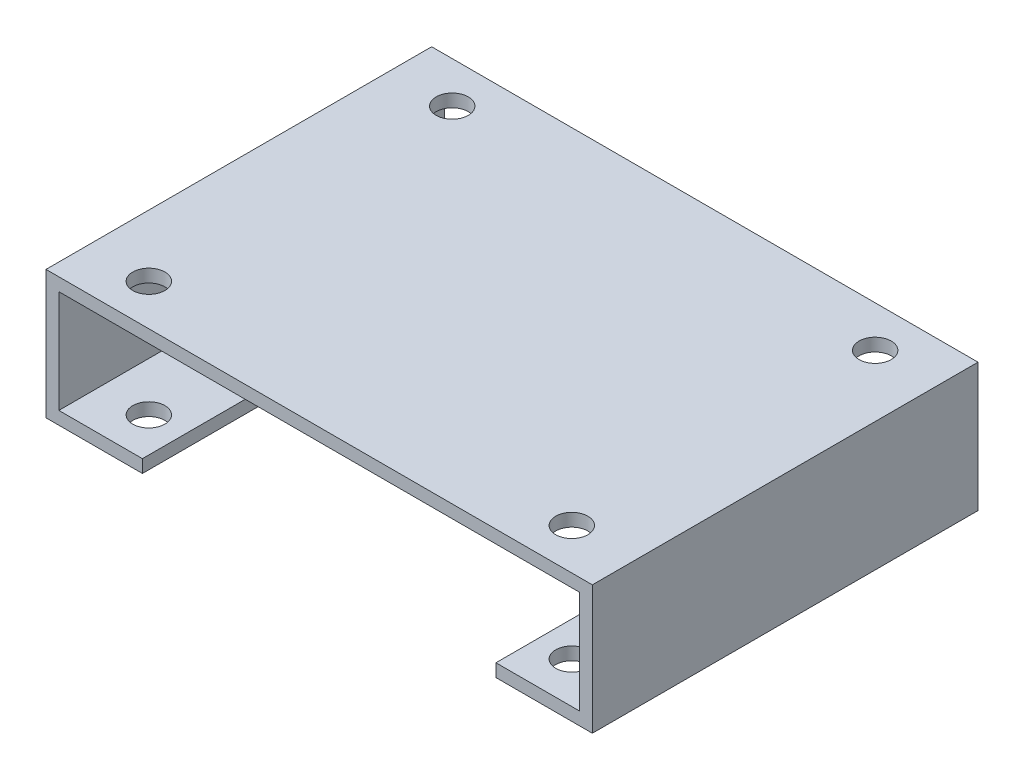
ISO-10303-21;
HEADER;
FILE_DESCRIPTION(('STEP AP214'),'2;1');
FILE_NAME('part.step','',(''),(''),'','','');
FILE_SCHEMA(('AUTOMOTIVE_DESIGN { 1 0 10303 214 1 1 1 1 }'));
ENDSEC;
DATA;
#1=APPLICATION_CONTEXT('core data for automotive mechanical design processes');
#2=APPLICATION_PROTOCOL_DEFINITION('international standard','automotive_design',2000,#1);
#3=PRODUCT_CONTEXT('',#1,'mechanical');
#4=PRODUCT('Part','Part','',(#3));
#5=PRODUCT_RELATED_PRODUCT_CATEGORY('part','',(#4));
#6=PRODUCT_DEFINITION_FORMATION('','',#4);
#7=PRODUCT_DEFINITION_CONTEXT('part definition',#1,'design');
#8=PRODUCT_DEFINITION('design','',#6,#7);
#9=PRODUCT_DEFINITION_SHAPE('','',#8);
#10=(LENGTH_UNIT() NAMED_UNIT(*) SI_UNIT(.MILLI.,.METRE.));
#11=(NAMED_UNIT(*) PLANE_ANGLE_UNIT() SI_UNIT($,.RADIAN.));
#12=(NAMED_UNIT(*) SI_UNIT($,.STERADIAN.) SOLID_ANGLE_UNIT());
#13=UNCERTAINTY_MEASURE_WITH_UNIT(LENGTH_MEASURE(1.E-05),#10,'distance_accuracy_value','');
#14=(GEOMETRIC_REPRESENTATION_CONTEXT(3) GLOBAL_UNCERTAINTY_ASSIGNED_CONTEXT((#13)) GLOBAL_UNIT_ASSIGNED_CONTEXT((#10,
#11,#12)) REPRESENTATION_CONTEXT('',''));
#15=CARTESIAN_POINT('',(0.,0.,0.));
#16=DIRECTION('',(0.,0.,1.));
#17=DIRECTION('',(1.,0.,0.));
#18=AXIS2_PLACEMENT_3D('',#15,#16,#17);
#19=CARTESIAN_POINT('',(53.975,2.54,76.2));
#20=DIRECTION('',(0.,-1.,0.));
#21=DIRECTION('',(1.,0.,0.));
#22=AXIS2_PLACEMENT_3D('',#19,#20,#21);
#23=PLANE('',#22);
#24=CARTESIAN_POINT('',(41.783,2.54,8.12800000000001));
#25=DIRECTION('',(0.,-1.,0.));
#26=DIRECTION('',(1.,0.,0.));
#27=AXIS2_PLACEMENT_3D('',#24,#25,#26);
#28=CIRCLE('',#27,3.175);
#29=CARTESIAN_POINT('',(44.958,2.54,8.12800000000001));
#30=VERTEX_POINT('',#29);
#31=EDGE_CURVE('E221',#30,#30,#28,.T.);
#32=ORIENTED_EDGE('',*,*,#31,.T.);
#33=EDGE_LOOP('',(#32));
#34=FACE_BOUND('',#33,.T.);
#35=CARTESIAN_POINT('',(41.783,2.54,68.072));
#36=DIRECTION('',(0.,-1.,0.));
#37=DIRECTION('',(1.,0.,0.));
#38=AXIS2_PLACEMENT_3D('',#35,#36,#37);
#39=CIRCLE('',#38,3.175);
#40=CARTESIAN_POINT('',(44.958,2.54,68.072));
#41=VERTEX_POINT('',#40);
#42=EDGE_CURVE('E208',#41,#41,#39,.T.);
#43=ORIENTED_EDGE('',*,*,#42,.T.);
#44=EDGE_LOOP('',(#43));
#45=FACE_BOUND('',#44,.T.);
#46=DIRECTION('',(-1.,0.,0.));
#47=VECTOR('',#46,1.);
#48=CARTESIAN_POINT('',(53.975,2.54,0.));
#49=LINE('',#48,#47);
#50=CARTESIAN_POINT('',(51.435,2.54,0.));
#51=VERTEX_POINT('',#50);
#52=CARTESIAN_POINT('',(34.925,2.54,0.));
#53=VERTEX_POINT('',#52);
#54=EDGE_CURVE('E152',#51,#53,#49,.T.);
#55=ORIENTED_EDGE('',*,*,#54,.T.);
#56=DIRECTION('',(0.,0.,-1.));
#57=VECTOR('',#56,1.);
#58=CARTESIAN_POINT('',(34.925,2.54,76.2));
#59=LINE('',#58,#57);
#60=CARTESIAN_POINT('',(34.925,2.54,76.2));
#61=VERTEX_POINT('',#60);
#62=EDGE_CURVE('E11',#61,#53,#59,.T.);
#63=ORIENTED_EDGE('',*,*,#62,.F.);
#64=DIRECTION('',(-1.,0.,0.));
#65=VECTOR('',#64,1.);
#66=CARTESIAN_POINT('',(53.975,2.54,76.2));
#67=LINE('',#66,#65);
#68=CARTESIAN_POINT('',(51.435,2.54,76.2));
#69=VERTEX_POINT('',#68);
#70=EDGE_CURVE('E100',#69,#61,#67,.T.);
#71=ORIENTED_EDGE('',*,*,#70,.F.);
#72=DIRECTION('',(0.,0.,-1.));
#73=VECTOR('',#72,1.);
#74=CARTESIAN_POINT('',(51.435,2.54,76.2));
#75=LINE('',#74,#73);
#76=EDGE_CURVE('E148',#69,#51,#75,.T.);
#77=ORIENTED_EDGE('',*,*,#76,.T.);
#78=EDGE_LOOP('',(#55,#63,#71,#77));
#79=FACE_BOUND('',#78,.T.);
#80=ADVANCED_FACE('F30',(#34,#45,#79),#23,.F.);
#81=CARTESIAN_POINT('',(34.925,0.,76.2));
#82=DIRECTION('',(-1.,0.,0.));
#83=DIRECTION('',(0.,0.,1.));
#84=AXIS2_PLACEMENT_3D('',#81,#82,#83);
#85=PLANE('',#84);
#86=DIRECTION('',(0.,1.,0.));
#87=VECTOR('',#86,1.);
#88=CARTESIAN_POINT('',(34.925,0.,0.));
#89=LINE('',#88,#87);
#90=CARTESIAN_POINT('',(34.925,0.,0.));
#91=VERTEX_POINT('',#90);
#92=EDGE_CURVE('E155',#91,#53,#89,.T.);
#93=ORIENTED_EDGE('',*,*,#92,.F.);
#94=DIRECTION('',(0.,0.,-1.));
#95=VECTOR('',#94,1.);
#96=CARTESIAN_POINT('',(34.925,0.,76.2));
#97=LINE('',#96,#95);
#98=CARTESIAN_POINT('',(34.925,0.,76.2));
#99=VERTEX_POINT('',#98);
#100=EDGE_CURVE('E39',#99,#91,#97,.T.);
#101=ORIENTED_EDGE('',*,*,#100,.F.);
#102=DIRECTION('',(0.,1.,0.));
#103=VECTOR('',#102,1.);
#104=CARTESIAN_POINT('',(34.925,0.,76.2));
#105=LINE('',#104,#103);
#106=EDGE_CURVE('E240',#99,#61,#105,.T.);
#107=ORIENTED_EDGE('',*,*,#106,.T.);
#108=ORIENTED_EDGE('',*,*,#62,.T.);
#109=EDGE_LOOP('',(#93,#101,#107,#108));
#110=FACE_BOUND('',#109,.T.);
#111=ADVANCED_FACE('F287',(#110),#85,.T.);
#112=CARTESIAN_POINT('',(53.975,0.,76.2));
#113=DIRECTION('',(0.,-1.,0.));
#114=DIRECTION('',(1.,0.,0.));
#115=AXIS2_PLACEMENT_3D('',#112,#113,#114);
#116=PLANE('',#115);
#117=CARTESIAN_POINT('',(41.783,0.,8.12800000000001));
#118=DIRECTION('',(0.,-1.,0.));
#119=DIRECTION('',(1.,0.,0.));
#120=AXIS2_PLACEMENT_3D('',#117,#118,#119);
#121=CIRCLE('',#120,3.175);
#122=CARTESIAN_POINT('',(44.958,0.,8.12800000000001));
#123=VERTEX_POINT('',#122);
#124=EDGE_CURVE('E332',#123,#123,#121,.T.);
#125=ORIENTED_EDGE('',*,*,#124,.F.);
#126=EDGE_LOOP('',(#125));
#127=FACE_BOUND('',#126,.T.);
#128=CARTESIAN_POINT('',(41.783,0.,68.072));
#129=DIRECTION('',(0.,-1.,0.));
#130=DIRECTION('',(1.,0.,0.));
#131=AXIS2_PLACEMENT_3D('',#128,#129,#130);
#132=CIRCLE('',#131,3.175);
#133=CARTESIAN_POINT('',(44.958,0.,68.072));
#134=VERTEX_POINT('',#133);
#135=EDGE_CURVE('E216',#134,#134,#132,.T.);
#136=ORIENTED_EDGE('',*,*,#135,.F.);
#137=EDGE_LOOP('',(#136));
#138=FACE_BOUND('',#137,.T.);
#139=DIRECTION('',(-1.,0.,0.));
#140=VECTOR('',#139,1.);
#141=CARTESIAN_POINT('',(53.975,0.,0.));
#142=LINE('',#141,#140);
#143=CARTESIAN_POINT('',(53.975,0.,0.));
#144=VERTEX_POINT('',#143);
#145=EDGE_CURVE('E159',#144,#91,#142,.T.);
#146=ORIENTED_EDGE('',*,*,#145,.F.);
#147=DIRECTION('',(0.,0.,-1.));
#148=VECTOR('',#147,1.);
#149=CARTESIAN_POINT('',(53.975,0.,76.2));
#150=LINE('',#149,#148);
#151=CARTESIAN_POINT('',(53.975,0.,76.2));
#152=VERTEX_POINT('',#151);
#153=EDGE_CURVE('E195',#152,#144,#150,.T.);
#154=ORIENTED_EDGE('',*,*,#153,.F.);
#155=DIRECTION('',(-1.,0.,0.));
#156=VECTOR('',#155,1.);
#157=CARTESIAN_POINT('',(53.975,0.,76.2));
#158=LINE('',#157,#156);
#159=EDGE_CURVE('E243',#152,#99,#158,.T.);
#160=ORIENTED_EDGE('',*,*,#159,.T.);
#161=ORIENTED_EDGE('',*,*,#100,.T.);
#162=EDGE_LOOP('',(#146,#154,#160,#161));
#163=FACE_BOUND('',#162,.T.);
#164=ADVANCED_FACE('F292',(#127,#138,#163),#116,.T.);
#165=CARTESIAN_POINT('',(53.975,25.4,76.2));
#166=DIRECTION('',(1.,0.,0.));
#167=DIRECTION('',(0.,0.,-1.));
#168=AXIS2_PLACEMENT_3D('',#165,#166,#167);
#169=PLANE('',#168);
#170=DIRECTION('',(0.,-1.,0.));
#171=VECTOR('',#170,1.);
#172=CARTESIAN_POINT('',(53.975,25.4,0.));
#173=LINE('',#172,#171);
#174=CARTESIAN_POINT('',(53.975,25.4,0.));
#175=VERTEX_POINT('',#174);
#176=EDGE_CURVE('E162',#175,#144,#173,.T.);
#177=ORIENTED_EDGE('',*,*,#176,.F.);
#178=DIRECTION('',(0.,0.,-1.));
#179=VECTOR('',#178,1.);
#180=CARTESIAN_POINT('',(53.975,25.4,76.2));
#181=LINE('',#180,#179);
#182=CARTESIAN_POINT('',(53.975,25.4,76.2));
#183=VERTEX_POINT('',#182);
#184=EDGE_CURVE('E193',#183,#175,#181,.T.);
#185=ORIENTED_EDGE('',*,*,#184,.F.);
#186=DIRECTION('',(0.,-1.,0.));
#187=VECTOR('',#186,1.);
#188=CARTESIAN_POINT('',(53.975,25.4,76.2));
#189=LINE('',#188,#187);
#190=EDGE_CURVE('E246',#183,#152,#189,.T.);
#191=ORIENTED_EDGE('',*,*,#190,.T.);
#192=ORIENTED_EDGE('',*,*,#153,.T.);
#193=EDGE_LOOP('',(#177,#185,#191,#192));
#194=FACE_BOUND('',#193,.T.);
#195=ADVANCED_FACE('F306',(#194),#169,.T.);
#196=CARTESIAN_POINT('',(-53.975,25.4,76.2));
#197=DIRECTION('',(0.,1.,0.));
#198=DIRECTION('',(0.,0.,1.));
#199=AXIS2_PLACEMENT_3D('',#196,#197,#198);
#200=PLANE('',#199);
#201=CARTESIAN_POINT('',(41.783,25.4,8.12800000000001));
#202=DIRECTION('',(0.,-1.,0.));
#203=DIRECTION('',(1.,0.,0.));
#204=AXIS2_PLACEMENT_3D('',#201,#202,#203);
#205=CIRCLE('',#204,3.175);
#206=CARTESIAN_POINT('',(44.958,25.4,8.12800000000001));
#207=VERTEX_POINT('',#206);
#208=EDGE_CURVE('E427',#207,#207,#205,.T.);
#209=ORIENTED_EDGE('',*,*,#208,.T.);
#210=EDGE_LOOP('',(#209));
#211=FACE_BOUND('',#210,.T.);
#212=CARTESIAN_POINT('',(41.783,25.4,68.072));
#213=DIRECTION('',(0.,-1.,0.));
#214=DIRECTION('',(1.,0.,0.));
#215=AXIS2_PLACEMENT_3D('',#212,#213,#214);
#216=CIRCLE('',#215,3.175);
#217=CARTESIAN_POINT('',(44.958,25.4,68.072));
#218=VERTEX_POINT('',#217);
#219=EDGE_CURVE('E209',#218,#218,#216,.T.);
#220=ORIENTED_EDGE('',*,*,#219,.T.);
#221=EDGE_LOOP('',(#220));
#222=FACE_BOUND('',#221,.T.);
#223=CARTESIAN_POINT('',(-41.783,25.4,8.12800000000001));
#224=DIRECTION('',(0.,-1.,0.));
#225=DIRECTION('',(1.,0.,0.));
#226=AXIS2_PLACEMENT_3D('',#223,#224,#225);
#227=CIRCLE('',#226,3.175);
#228=CARTESIAN_POINT('',(-38.608,25.4,8.12800000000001));
#229=VERTEX_POINT('',#228);
#230=EDGE_CURVE('E205',#229,#229,#227,.T.);
#231=ORIENTED_EDGE('',*,*,#230,.T.);
#232=EDGE_LOOP('',(#231));
#233=FACE_BOUND('',#232,.T.);
#234=CARTESIAN_POINT('',(-41.783,25.4,68.072));
#235=DIRECTION('',(0.,-1.,0.));
#236=DIRECTION('',(1.,0.,0.));
#237=AXIS2_PLACEMENT_3D('',#234,#235,#236);
#238=CIRCLE('',#237,3.175);
#239=CARTESIAN_POINT('',(-38.608,25.4,68.072));
#240=VERTEX_POINT('',#239);
#241=EDGE_CURVE('E201',#240,#240,#238,.T.);
#242=ORIENTED_EDGE('',*,*,#241,.T.);
#243=EDGE_LOOP('',(#242));
#244=FACE_BOUND('',#243,.T.);
#245=DIRECTION('',(1.,0.,0.));
#246=VECTOR('',#245,1.);
#247=CARTESIAN_POINT('',(-53.975,25.4,0.));
#248=LINE('',#247,#246);
#249=CARTESIAN_POINT('',(-53.975,25.4,0.));
#250=VERTEX_POINT('',#249);
#251=EDGE_CURVE('E165',#250,#175,#248,.T.);
#252=ORIENTED_EDGE('',*,*,#251,.F.);
#253=DIRECTION('',(0.,0.,-1.));
#254=VECTOR('',#253,1.);
#255=CARTESIAN_POINT('',(-53.975,25.4,76.2));
#256=LINE('',#255,#254);
#257=CARTESIAN_POINT('',(-53.975,25.4,76.2));
#258=VERTEX_POINT('',#257);
#259=EDGE_CURVE('E191',#258,#250,#256,.T.);
#260=ORIENTED_EDGE('',*,*,#259,.F.);
#261=DIRECTION('',(1.,0.,0.));
#262=VECTOR('',#261,1.);
#263=CARTESIAN_POINT('',(-53.975,25.4,76.2));
#264=LINE('',#263,#262);
#265=EDGE_CURVE('E249',#258,#183,#264,.T.);
#266=ORIENTED_EDGE('',*,*,#265,.T.);
#267=ORIENTED_EDGE('',*,*,#184,.T.);
#268=EDGE_LOOP('',(#252,#260,#266,#267));
#269=FACE_BOUND('',#268,.T.);
#270=ADVANCED_FACE('F309',(#211,#222,#233,#244,#269),#200,.T.);
#271=CARTESIAN_POINT('',(-53.975,0.,76.2));
#272=DIRECTION('',(-1.,0.,0.));
#273=DIRECTION('',(0.,0.,1.));
#274=AXIS2_PLACEMENT_3D('',#271,#272,#273);
#275=PLANE('',#274);
#276=DIRECTION('',(0.,1.,0.));
#277=VECTOR('',#276,1.);
#278=CARTESIAN_POINT('',(-53.975,0.,0.));
#279=LINE('',#278,#277);
#280=CARTESIAN_POINT('',(-53.975,0.,0.));
#281=VERTEX_POINT('',#280);
#282=EDGE_CURVE('E168',#281,#250,#279,.T.);
#283=ORIENTED_EDGE('',*,*,#282,.F.);
#284=DIRECTION('',(0.,0.,-1.));
#285=VECTOR('',#284,1.);
#286=CARTESIAN_POINT('',(-53.975,0.,76.2));
#287=LINE('',#286,#285);
#288=CARTESIAN_POINT('',(-53.975,0.,76.2));
#289=VERTEX_POINT('',#288);
#290=EDGE_CURVE('E189',#289,#281,#287,.T.);
#291=ORIENTED_EDGE('',*,*,#290,.F.);
#292=DIRECTION('',(0.,1.,0.));
#293=VECTOR('',#292,1.);
#294=CARTESIAN_POINT('',(-53.975,0.,76.2));
#295=LINE('',#294,#293);
#296=EDGE_CURVE('E252',#289,#258,#295,.T.);
#297=ORIENTED_EDGE('',*,*,#296,.T.);
#298=ORIENTED_EDGE('',*,*,#259,.T.);
#299=EDGE_LOOP('',(#283,#291,#297,#298));
#300=FACE_BOUND('',#299,.T.);
#301=ADVANCED_FACE('F311',(#300),#275,.T.);
#302=CARTESIAN_POINT('',(-34.925,0.,76.2));
#303=DIRECTION('',(0.,-1.,0.));
#304=DIRECTION('',(1.,0.,0.));
#305=AXIS2_PLACEMENT_3D('',#302,#303,#304);
#306=PLANE('',#305);
#307=CARTESIAN_POINT('',(-41.783,0.,8.12800000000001));
#308=DIRECTION('',(0.,-1.,0.));
#309=DIRECTION('',(1.,0.,0.));
#310=AXIS2_PLACEMENT_3D('',#307,#308,#309);
#311=CIRCLE('',#310,3.175);
#312=CARTESIAN_POINT('',(-38.608,0.,8.12800000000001));
#313=VERTEX_POINT('',#312);
#314=EDGE_CURVE('E213',#313,#313,#311,.T.);
#315=ORIENTED_EDGE('',*,*,#314,.F.);
#316=EDGE_LOOP('',(#315));
#317=FACE_BOUND('',#316,.T.);
#318=CARTESIAN_POINT('',(-41.783,0.,68.072));
#319=DIRECTION('',(0.,-1.,0.));
#320=DIRECTION('',(1.,0.,0.));
#321=AXIS2_PLACEMENT_3D('',#318,#319,#320);
#322=CIRCLE('',#321,3.175);
#323=CARTESIAN_POINT('',(-38.608,0.,68.072));
#324=VERTEX_POINT('',#323);
#325=EDGE_CURVE('E232',#324,#324,#322,.T.);
#326=ORIENTED_EDGE('',*,*,#325,.F.);
#327=EDGE_LOOP('',(#326));
#328=FACE_BOUND('',#327,.T.);
#329=DIRECTION('',(-1.,0.,0.));
#330=VECTOR('',#329,1.);
#331=CARTESIAN_POINT('',(-34.925,0.,0.));
#332=LINE('',#331,#330);
#333=CARTESIAN_POINT('',(-34.925,0.,0.));
#334=VERTEX_POINT('',#333);
#335=EDGE_CURVE('E171',#334,#281,#332,.T.);
#336=ORIENTED_EDGE('',*,*,#335,.F.);
#337=DIRECTION('',(0.,0.,-1.));
#338=VECTOR('',#337,1.);
#339=CARTESIAN_POINT('',(-34.925,0.,76.2));
#340=LINE('',#339,#338);
#341=CARTESIAN_POINT('',(-34.925,0.,76.2));
#342=VERTEX_POINT('',#341);
#343=EDGE_CURVE('E187',#342,#334,#340,.T.);
#344=ORIENTED_EDGE('',*,*,#343,.F.);
#345=DIRECTION('',(-1.,0.,0.));
#346=VECTOR('',#345,1.);
#347=CARTESIAN_POINT('',(-34.925,0.,76.2));
#348=LINE('',#347,#346);
#349=EDGE_CURVE('E255',#342,#289,#348,.T.);
#350=ORIENTED_EDGE('',*,*,#349,.T.);
#351=ORIENTED_EDGE('',*,*,#290,.T.);
#352=EDGE_LOOP('',(#336,#344,#350,#351));
#353=FACE_BOUND('',#352,.T.);
#354=ADVANCED_FACE('F268',(#317,#328,#353),#306,.T.);
#355=CARTESIAN_POINT('',(-34.925,2.54,76.2));
#356=DIRECTION('',(1.,0.,0.));
#357=DIRECTION('',(0.,0.,-1.));
#358=AXIS2_PLACEMENT_3D('',#355,#356,#357);
#359=PLANE('',#358);
#360=DIRECTION('',(0.,-1.,0.));
#361=VECTOR('',#360,1.);
#362=CARTESIAN_POINT('',(-34.925,2.54,0.));
#363=LINE('',#362,#361);
#364=CARTESIAN_POINT('',(-34.925,2.54,0.));
#365=VERTEX_POINT('',#364);
#366=EDGE_CURVE('E174',#365,#334,#363,.T.);
#367=ORIENTED_EDGE('',*,*,#366,.F.);
#368=DIRECTION('',(0.,0.,-1.));
#369=VECTOR('',#368,1.);
#370=CARTESIAN_POINT('',(-34.925,2.54,76.2));
#371=LINE('',#370,#369);
#372=CARTESIAN_POINT('',(-34.925,2.54,76.2));
#373=VERTEX_POINT('',#372);
#374=EDGE_CURVE('E185',#373,#365,#371,.T.);
#375=ORIENTED_EDGE('',*,*,#374,.F.);
#376=DIRECTION('',(0.,-1.,0.));
#377=VECTOR('',#376,1.);
#378=CARTESIAN_POINT('',(-34.925,2.54,76.2));
#379=LINE('',#378,#377);
#380=EDGE_CURVE('E258',#373,#342,#379,.T.);
#381=ORIENTED_EDGE('',*,*,#380,.T.);
#382=ORIENTED_EDGE('',*,*,#343,.T.);
#383=EDGE_LOOP('',(#367,#375,#381,#382));
#384=FACE_BOUND('',#383,.T.);
#385=ADVANCED_FACE('F262',(#384),#359,.T.);
#386=CARTESIAN_POINT('',(-34.925,2.54,76.2));
#387=DIRECTION('',(0.,-1.,0.));
#388=DIRECTION('',(1.,0.,0.));
#389=AXIS2_PLACEMENT_3D('',#386,#387,#388);
#390=PLANE('',#389);
#391=CARTESIAN_POINT('',(-41.783,2.54,8.12800000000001));
#392=DIRECTION('',(0.,-1.,0.));
#393=DIRECTION('',(1.,0.,0.));
#394=AXIS2_PLACEMENT_3D('',#391,#392,#393);
#395=CIRCLE('',#394,3.175);
#396=CARTESIAN_POINT('',(-38.608,2.54,8.12800000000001));
#397=VERTEX_POINT('',#396);
#398=EDGE_CURVE('E204',#397,#397,#395,.T.);
#399=ORIENTED_EDGE('',*,*,#398,.T.);
#400=EDGE_LOOP('',(#399));
#401=FACE_BOUND('',#400,.T.);
#402=CARTESIAN_POINT('',(-41.783,2.54,68.072));
#403=DIRECTION('',(0.,-1.,0.));
#404=DIRECTION('',(1.,0.,0.));
#405=AXIS2_PLACEMENT_3D('',#402,#403,#404);
#406=CIRCLE('',#405,3.175);
#407=CARTESIAN_POINT('',(-38.608,2.54,68.072));
#408=VERTEX_POINT('',#407);
#409=EDGE_CURVE('E156',#408,#408,#406,.T.);
#410=ORIENTED_EDGE('',*,*,#409,.T.);
#411=EDGE_LOOP('',(#410));
#412=FACE_BOUND('',#411,.T.);
#413=DIRECTION('',(-1.,0.,0.));
#414=VECTOR('',#413,1.);
#415=CARTESIAN_POINT('',(-34.925,2.54,0.));
#416=LINE('',#415,#414);
#417=CARTESIAN_POINT('',(-51.435,2.54,0.));
#418=VERTEX_POINT('',#417);
#419=EDGE_CURVE('E177',#365,#418,#416,.T.);
#420=ORIENTED_EDGE('',*,*,#419,.T.);
#421=DIRECTION('',(0.,0.,-1.));
#422=VECTOR('',#421,1.);
#423=CARTESIAN_POINT('',(-51.435,2.54,76.2));
#424=LINE('',#423,#422);
#425=CARTESIAN_POINT('',(-51.435,2.54,76.2));
#426=VERTEX_POINT('',#425);
#427=EDGE_CURVE('E143',#426,#418,#424,.T.);
#428=ORIENTED_EDGE('',*,*,#427,.F.);
#429=DIRECTION('',(-1.,0.,0.));
#430=VECTOR('',#429,1.);
#431=CARTESIAN_POINT('',(-34.925,2.54,76.2));
#432=LINE('',#431,#430);
#433=EDGE_CURVE('E134',#373,#426,#432,.T.);
#434=ORIENTED_EDGE('',*,*,#433,.F.);
#435=ORIENTED_EDGE('',*,*,#374,.T.);
#436=EDGE_LOOP('',(#420,#428,#434,#435));
#437=FACE_BOUND('',#436,.T.);
#438=ADVANCED_FACE('F275',(#401,#412,#437),#390,.F.);
#439=CARTESIAN_POINT('',(-51.435,0.,76.2));
#440=DIRECTION('',(-1.,0.,0.));
#441=DIRECTION('',(0.,0.,1.));
#442=AXIS2_PLACEMENT_3D('',#439,#440,#441);
#443=PLANE('',#442);
#444=DIRECTION('',(0.,1.,0.));
#445=VECTOR('',#444,1.);
#446=CARTESIAN_POINT('',(-51.435,0.,0.));
#447=LINE('',#446,#445);
#448=CARTESIAN_POINT('',(-51.435,22.86,0.));
#449=VERTEX_POINT('',#448);
#450=EDGE_CURVE('E142',#418,#449,#447,.T.);
#451=ORIENTED_EDGE('',*,*,#450,.T.);
#452=DIRECTION('',(0.,0.,-1.));
#453=VECTOR('',#452,1.);
#454=CARTESIAN_POINT('',(-51.435,22.86,76.2));
#455=LINE('',#454,#453);
#456=CARTESIAN_POINT('',(-51.435,22.86,76.2));
#457=VERTEX_POINT('',#456);
#458=EDGE_CURVE('E139',#457,#449,#455,.T.);
#459=ORIENTED_EDGE('',*,*,#458,.F.);
#460=DIRECTION('',(0.,1.,0.));
#461=VECTOR('',#460,1.);
#462=CARTESIAN_POINT('',(-51.435,0.,76.2));
#463=LINE('',#462,#461);
#464=EDGE_CURVE('E127',#426,#457,#463,.T.);
#465=ORIENTED_EDGE('',*,*,#464,.F.);
#466=ORIENTED_EDGE('',*,*,#427,.T.);
#467=EDGE_LOOP('',(#451,#459,#465,#466));
#468=FACE_BOUND('',#467,.T.);
#469=ADVANCED_FACE('F140',(#468),#443,.F.);
#470=CARTESIAN_POINT('',(-53.975,22.86,76.2));
#471=DIRECTION('',(0.,1.,0.));
#472=DIRECTION('',(0.,0.,1.));
#473=AXIS2_PLACEMENT_3D('',#470,#471,#472);
#474=PLANE('',#473);
#475=CARTESIAN_POINT('',(41.783,22.86,8.12800000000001));
#476=DIRECTION('',(0.,1.,0.));
#477=DIRECTION('',(0.,0.,1.));
#478=AXIS2_PLACEMENT_3D('',#475,#476,#477);
#479=CIRCLE('',#478,3.175);
#480=CARTESIAN_POINT('',(44.958,22.86,8.12800000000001));
#481=VERTEX_POINT('',#480);
#482=EDGE_CURVE('E33',#481,#481,#479,.T.);
#483=ORIENTED_EDGE('',*,*,#482,.T.);
#484=EDGE_LOOP('',(#483));
#485=FACE_BOUND('',#484,.T.);
#486=CARTESIAN_POINT('',(41.783,22.86,68.072));
#487=DIRECTION('',(0.,1.,0.));
#488=DIRECTION('',(0.,0.,1.));
#489=AXIS2_PLACEMENT_3D('',#486,#487,#488);
#490=CIRCLE('',#489,3.175);
#491=CARTESIAN_POINT('',(44.958,22.86,68.072));
#492=VERTEX_POINT('',#491);
#493=EDGE_CURVE('E206',#492,#492,#490,.T.);
#494=ORIENTED_EDGE('',*,*,#493,.T.);
#495=EDGE_LOOP('',(#494));
#496=FACE_BOUND('',#495,.T.);
#497=CARTESIAN_POINT('',(-41.783,22.86,8.12800000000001));
#498=DIRECTION('',(0.,1.,0.));
#499=DIRECTION('',(0.,0.,1.));
#500=AXIS2_PLACEMENT_3D('',#497,#498,#499);
#501=CIRCLE('',#500,3.175);
#502=CARTESIAN_POINT('',(-38.608,22.86,8.12800000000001));
#503=VERTEX_POINT('',#502);
#504=EDGE_CURVE('E202',#503,#503,#501,.T.);
#505=ORIENTED_EDGE('',*,*,#504,.T.);
#506=EDGE_LOOP('',(#505));
#507=FACE_BOUND('',#506,.T.);
#508=CARTESIAN_POINT('',(-41.783,22.86,68.072));
#509=DIRECTION('',(0.,1.,0.));
#510=DIRECTION('',(0.,0.,1.));
#511=AXIS2_PLACEMENT_3D('',#508,#509,#510);
#512=CIRCLE('',#511,3.175);
#513=CARTESIAN_POINT('',(-38.608,22.86,68.072));
#514=VERTEX_POINT('',#513);
#515=EDGE_CURVE('E198',#514,#514,#512,.T.);
#516=ORIENTED_EDGE('',*,*,#515,.T.);
#517=EDGE_LOOP('',(#516));
#518=FACE_BOUND('',#517,.T.);
#519=DIRECTION('',(1.,0.,0.));
#520=VECTOR('',#519,1.);
#521=CARTESIAN_POINT('',(-53.975,22.86,0.));
#522=LINE('',#521,#520);
#523=CARTESIAN_POINT('',(51.435,22.86,0.));
#524=VERTEX_POINT('',#523);
#525=EDGE_CURVE('E88',#449,#524,#522,.T.);
#526=ORIENTED_EDGE('',*,*,#525,.T.);
#527=DIRECTION('',(0.,0.,-1.));
#528=VECTOR('',#527,1.);
#529=CARTESIAN_POINT('',(51.435,22.86,76.2));
#530=LINE('',#529,#528);
#531=CARTESIAN_POINT('',(51.435,22.86,76.2));
#532=VERTEX_POINT('',#531);
#533=EDGE_CURVE('E144',#532,#524,#530,.T.);
#534=ORIENTED_EDGE('',*,*,#533,.F.);
#535=DIRECTION('',(1.,0.,0.));
#536=VECTOR('',#535,1.);
#537=CARTESIAN_POINT('',(-53.975,22.86,76.2));
#538=LINE('',#537,#536);
#539=EDGE_CURVE('E131',#457,#532,#538,.T.);
#540=ORIENTED_EDGE('',*,*,#539,.F.);
#541=ORIENTED_EDGE('',*,*,#458,.T.);
#542=EDGE_LOOP('',(#526,#534,#540,#541));
#543=FACE_BOUND('',#542,.T.);
#544=ADVANCED_FACE('F146',(#485,#496,#507,#518,#543),#474,.F.);
#545=CARTESIAN_POINT('',(51.435,25.4,76.2));
#546=DIRECTION('',(1.,0.,0.));
#547=DIRECTION('',(0.,0.,-1.));
#548=AXIS2_PLACEMENT_3D('',#545,#546,#547);
#549=PLANE('',#548);
#550=DIRECTION('',(0.,1.,0.));
#551=VECTOR('',#550,1.);
#552=CARTESIAN_POINT('',(51.435,25.4,0.));
#553=LINE('',#552,#551);
#554=EDGE_CURVE('E94',#524,#51,#553,.F.);
#555=ORIENTED_EDGE('',*,*,#554,.T.);
#556=ORIENTED_EDGE('',*,*,#76,.F.);
#557=DIRECTION('',(0.,1.,0.));
#558=VECTOR('',#557,1.);
#559=CARTESIAN_POINT('',(51.435,25.4,76.2));
#560=LINE('',#559,#558);
#561=EDGE_CURVE('E48',#532,#69,#560,.F.);
#562=ORIENTED_EDGE('',*,*,#561,.F.);
#563=ORIENTED_EDGE('',*,*,#533,.T.);
#564=EDGE_LOOP('',(#555,#556,#562,#563));
#565=FACE_BOUND('',#564,.T.);
#566=ADVANCED_FACE('F362',(#565),#549,.F.);
#567=CARTESIAN_POINT('',(34.925,2.54,76.2));
#568=DIRECTION('',(0.,0.,-1.));
#569=DIRECTION('',(-1.,0.,0.));
#570=AXIS2_PLACEMENT_3D('',#567,#568,#569);
#571=PLANE('',#570);
#572=ORIENTED_EDGE('',*,*,#70,.T.);
#573=ORIENTED_EDGE('',*,*,#106,.F.);
#574=ORIENTED_EDGE('',*,*,#159,.F.);
#575=ORIENTED_EDGE('',*,*,#190,.F.);
#576=ORIENTED_EDGE('',*,*,#265,.F.);
#577=ORIENTED_EDGE('',*,*,#296,.F.);
#578=ORIENTED_EDGE('',*,*,#349,.F.);
#579=ORIENTED_EDGE('',*,*,#380,.F.);
#580=ORIENTED_EDGE('',*,*,#433,.T.);
#581=ORIENTED_EDGE('',*,*,#464,.T.);
#582=ORIENTED_EDGE('',*,*,#539,.T.);
#583=ORIENTED_EDGE('',*,*,#561,.T.);
#584=EDGE_LOOP('',(#572,#573,#574,#575,#576,#577,#578,#579,#580,#581,#582,#583));
#585=FACE_BOUND('',#584,.T.);
#586=ADVANCED_FACE('F129',(#585),#571,.F.);
#587=CARTESIAN_POINT('',(34.925,2.54,0.));
#588=DIRECTION('',(0.,0.,-1.));
#589=DIRECTION('',(-1.,0.,0.));
#590=AXIS2_PLACEMENT_3D('',#587,#588,#589);
#591=PLANE('',#590);
#592=ORIENTED_EDGE('',*,*,#54,.F.);
#593=ORIENTED_EDGE('',*,*,#554,.F.);
#594=ORIENTED_EDGE('',*,*,#525,.F.);
#595=ORIENTED_EDGE('',*,*,#450,.F.);
#596=ORIENTED_EDGE('',*,*,#419,.F.);
#597=ORIENTED_EDGE('',*,*,#366,.T.);
#598=ORIENTED_EDGE('',*,*,#335,.T.);
#599=ORIENTED_EDGE('',*,*,#282,.T.);
#600=ORIENTED_EDGE('',*,*,#251,.T.);
#601=ORIENTED_EDGE('',*,*,#176,.T.);
#602=ORIENTED_EDGE('',*,*,#145,.T.);
#603=ORIENTED_EDGE('',*,*,#92,.T.);
#604=EDGE_LOOP('',(#592,#593,#594,#595,#596,#597,#598,#599,#600,#601,#602,#603));
#605=FACE_BOUND('',#604,.T.);
#606=ADVANCED_FACE('F273',(#605),#591,.T.);
#607=CARTESIAN_POINT('',(-41.783,25.4,68.072));
#608=DIRECTION('',(0.,-1.,0.));
#609=DIRECTION('',(1.,0.,0.));
#610=AXIS2_PLACEMENT_3D('',#607,#608,#609);
#611=CYLINDRICAL_SURFACE('',#610,3.175);
#612=CARTESIAN_POINT('',(-38.608,25.4,68.072));
#613=CARTESIAN_POINT('',(-38.608,25.3735416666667,68.072));
#614=CARTESIAN_POINT('',(-38.608,25.3470833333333,68.072));
#615=CARTESIAN_POINT('',(-38.608,25.2941666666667,68.072));
#616=CARTESIAN_POINT('',(-38.608,25.2677083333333,68.072));
#617=CARTESIAN_POINT('',(-38.608,25.2147916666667,68.072));
#618=CARTESIAN_POINT('',(-38.608,25.1883333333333,68.072));
#619=CARTESIAN_POINT('',(-38.608,25.1354166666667,68.072));
#620=CARTESIAN_POINT('',(-38.608,25.1089583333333,68.072));
#621=CARTESIAN_POINT('',(-38.608,25.0560416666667,68.072));
#622=CARTESIAN_POINT('',(-38.608,25.0295833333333,68.072));
#623=CARTESIAN_POINT('',(-38.608,24.9766666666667,68.072));
#624=CARTESIAN_POINT('',(-38.608,24.9502083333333,68.072));
#625=CARTESIAN_POINT('',(-38.608,24.8972916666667,68.072));
#626=CARTESIAN_POINT('',(-38.608,24.8708333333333,68.072));
#627=CARTESIAN_POINT('',(-38.608,24.8179166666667,68.072));
#628=CARTESIAN_POINT('',(-38.608,24.7914583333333,68.072));
#629=CARTESIAN_POINT('',(-38.608,24.7385416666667,68.072));
#630=CARTESIAN_POINT('',(-38.608,24.7120833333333,68.072));
#631=CARTESIAN_POINT('',(-38.608,24.6591666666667,68.072));
#632=CARTESIAN_POINT('',(-38.608,24.6327083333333,68.072));
#633=CARTESIAN_POINT('',(-38.608,24.5797916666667,68.072));
#634=CARTESIAN_POINT('',(-38.608,24.5533333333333,68.072));
#635=CARTESIAN_POINT('',(-38.608,24.5004166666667,68.072));
#636=CARTESIAN_POINT('',(-38.608,24.4739583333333,68.072));
#637=CARTESIAN_POINT('',(-38.608,24.4210416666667,68.072));
#638=CARTESIAN_POINT('',(-38.608,24.3945833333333,68.072));
#639=CARTESIAN_POINT('',(-38.608,24.3416666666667,68.072));
#640=CARTESIAN_POINT('',(-38.608,24.3152083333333,68.072));
#641=CARTESIAN_POINT('',(-38.608,24.2622916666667,68.072));
#642=CARTESIAN_POINT('',(-38.608,24.2358333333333,68.072));
#643=CARTESIAN_POINT('',(-38.608,24.1829166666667,68.072));
#644=CARTESIAN_POINT('',(-38.608,24.1564583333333,68.072));
#645=CARTESIAN_POINT('',(-38.608,24.1035416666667,68.072));
#646=CARTESIAN_POINT('',(-38.608,24.0770833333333,68.072));
#647=CARTESIAN_POINT('',(-38.608,24.0241666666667,68.072));
#648=CARTESIAN_POINT('',(-38.608,23.9977083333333,68.072));
#649=CARTESIAN_POINT('',(-38.608,23.9447916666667,68.072));
#650=CARTESIAN_POINT('',(-38.608,23.9183333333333,68.072));
#651=CARTESIAN_POINT('',(-38.608,23.8654166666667,68.072));
#652=CARTESIAN_POINT('',(-38.608,23.8389583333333,68.072));
#653=CARTESIAN_POINT('',(-38.608,23.7860416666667,68.072));
#654=CARTESIAN_POINT('',(-38.608,23.7595833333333,68.072));
#655=CARTESIAN_POINT('',(-38.608,23.7066666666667,68.072));
#656=CARTESIAN_POINT('',(-38.608,23.6802083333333,68.072));
#657=CARTESIAN_POINT('',(-38.608,23.6272916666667,68.072));
#658=CARTESIAN_POINT('',(-38.608,23.6008333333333,68.072));
#659=CARTESIAN_POINT('',(-38.608,23.5479166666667,68.072));
#660=CARTESIAN_POINT('',(-38.608,23.5214583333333,68.072));
#661=CARTESIAN_POINT('',(-38.608,23.4685416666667,68.072));
#662=CARTESIAN_POINT('',(-38.608,23.4420833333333,68.072));
#663=CARTESIAN_POINT('',(-38.608,23.3891666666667,68.072));
#664=CARTESIAN_POINT('',(-38.608,23.3627083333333,68.072));
#665=CARTESIAN_POINT('',(-38.608,23.3097916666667,68.072));
#666=CARTESIAN_POINT('',(-38.608,23.2833333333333,68.072));
#667=CARTESIAN_POINT('',(-38.608,23.2304166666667,68.072));
#668=CARTESIAN_POINT('',(-38.608,23.2039583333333,68.072));
#669=CARTESIAN_POINT('',(-38.608,23.1510416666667,68.072));
#670=CARTESIAN_POINT('',(-38.608,23.1245833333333,68.072));
#671=CARTESIAN_POINT('',(-38.608,23.0716666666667,68.072));
#672=CARTESIAN_POINT('',(-38.608,23.0452083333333,68.072));
#673=CARTESIAN_POINT('',(-38.608,22.9922916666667,68.072));
#674=CARTESIAN_POINT('',(-38.608,22.9658333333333,68.072));
#675=CARTESIAN_POINT('',(-38.608,22.9129166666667,68.072));
#676=CARTESIAN_POINT('',(-38.608,22.8864583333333,68.072));
#677=CARTESIAN_POINT('',(-38.608,22.86,68.072));
#678=B_SPLINE_CURVE_WITH_KNOTS('',3,(#612,#613,#614,#615,#616,#617,#618,#619,#620,#621,#622,
#623,#624,#625,#626,#627,#628,#629,#630,#631,#632,#633,#634,#635,#636,#637,#638,#639,#640,#641,
#642,#643,#644,#645,#646,#647,#648,#649,#650,#651,#652,#653,#654,#655,#656,#657,#658,#659,#660,
#661,#662,#663,#664,#665,#666,#667,#668,#669,#670,#671,#672,#673,#674,#675,#676,#677),
.UNSPECIFIED.,.F.,.F.,(4,2,2,2,2,2,2,2,2,2,2,2,2,2,2,2,2,2,2,2,2,2,2,2,2,2,2,2,2,2,2,2,4),(0.,
0.0793750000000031,0.158750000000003,0.238125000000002,0.317500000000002,0.396875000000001,
0.476250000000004,0.555625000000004,0.635000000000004,0.714375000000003,0.793750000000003,
0.873125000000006,0.952500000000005,1.031875,1.11125,1.190625,1.27,1.34937500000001,
1.42875000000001,1.50812500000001,1.58750000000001,1.66687500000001,1.74625000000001,
1.82562500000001,1.90500000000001,1.98437500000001,2.06375000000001,2.14312500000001,
2.22250000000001,2.30187500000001,2.38125000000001,2.46062500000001,2.54000000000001),.UNSPECIFIED.);
#679=EDGE_CURVE('BSEAM358',#240,#514,#678,.T.);
#680=ORIENTED_EDGE('',*,*,#241,.F.);
#681=ORIENTED_EDGE('',*,*,#515,.F.);
#682=ORIENTED_EDGE('',*,*,#679,.T.);
#683=ORIENTED_EDGE('',*,*,#679,.F.);
#684=EDGE_LOOP('',(#680,#682,#681,#683));
#685=FACE_BOUND('',#684,.T.);
#686=ADVANCED_FACE('F358',(#685),#611,.F.);
#687=CARTESIAN_POINT('',(-38.608,0.,68.072));
#688=CARTESIAN_POINT('',(-38.608,0.0264583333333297,68.072));
#689=CARTESIAN_POINT('',(-38.608,0.0529166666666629,68.072));
#690=CARTESIAN_POINT('',(-38.608,0.105833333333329,68.072));
#691=CARTESIAN_POINT('',(-38.608,0.132291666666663,68.072));
#692=CARTESIAN_POINT('',(-38.608,0.18520833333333,68.072));
#693=CARTESIAN_POINT('',(-38.608,0.211666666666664,68.072));
#694=CARTESIAN_POINT('',(-38.608,0.264583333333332,68.072));
#695=CARTESIAN_POINT('',(-38.608,0.291041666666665,68.072));
#696=CARTESIAN_POINT('',(-38.608,0.343958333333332,68.072));
#697=CARTESIAN_POINT('',(-38.608,0.370416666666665,68.072));
#698=CARTESIAN_POINT('',(-38.608,0.423333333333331,68.072));
#699=CARTESIAN_POINT('',(-38.608,0.449791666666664,68.072));
#700=CARTESIAN_POINT('',(-38.608,0.502708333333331,68.072));
#701=CARTESIAN_POINT('',(-38.608,0.529166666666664,68.072));
#702=CARTESIAN_POINT('',(-38.608,0.582083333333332,68.072));
#703=CARTESIAN_POINT('',(-38.608,0.608541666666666,68.072));
#704=CARTESIAN_POINT('',(-38.608,0.661458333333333,68.072));
#705=CARTESIAN_POINT('',(-38.608,0.687916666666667,68.072));
#706=CARTESIAN_POINT('',(-38.608,0.740833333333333,68.072));
#707=CARTESIAN_POINT('',(-38.608,0.767291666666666,68.072));
#708=CARTESIAN_POINT('',(-38.608,0.820208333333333,68.072));
#709=CARTESIAN_POINT('',(-38.608,0.846666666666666,68.072));
#710=CARTESIAN_POINT('',(-38.608,0.899583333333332,68.072));
#711=CARTESIAN_POINT('',(-38.608,0.926041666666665,68.072));
#712=CARTESIAN_POINT('',(-38.608,0.978958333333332,68.072));
#713=CARTESIAN_POINT('',(-38.608,1.00541666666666,68.072));
#714=CARTESIAN_POINT('',(-38.608,1.05833333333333,68.072));
#715=CARTESIAN_POINT('',(-38.608,1.08479166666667,68.072));
#716=CARTESIAN_POINT('',(-38.608,1.13770833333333,68.072));
#717=CARTESIAN_POINT('',(-38.608,1.16416666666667,68.072));
#718=CARTESIAN_POINT('',(-38.608,1.21708333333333,68.072));
#719=CARTESIAN_POINT('',(-38.608,1.24354166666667,68.072));
#720=CARTESIAN_POINT('',(-38.608,1.29645833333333,68.072));
#721=CARTESIAN_POINT('',(-38.608,1.32291666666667,68.072));
#722=CARTESIAN_POINT('',(-38.608,1.37583333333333,68.072));
#723=CARTESIAN_POINT('',(-38.608,1.40229166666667,68.072));
#724=CARTESIAN_POINT('',(-38.608,1.45520833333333,68.072));
#725=CARTESIAN_POINT('',(-38.608,1.48166666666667,68.072));
#726=CARTESIAN_POINT('',(-38.608,1.53458333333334,68.072));
#727=CARTESIAN_POINT('',(-38.608,1.56104166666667,68.072));
#728=CARTESIAN_POINT('',(-38.608,1.61395833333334,68.072));
#729=CARTESIAN_POINT('',(-38.608,1.64041666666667,68.072));
#730=CARTESIAN_POINT('',(-38.608,1.69333333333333,68.072));
#731=CARTESIAN_POINT('',(-38.608,1.71979166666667,68.072));
#732=CARTESIAN_POINT('',(-38.608,1.77270833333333,68.072));
#733=CARTESIAN_POINT('',(-38.608,1.79916666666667,68.072));
#734=CARTESIAN_POINT('',(-38.608,1.85208333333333,68.072));
#735=CARTESIAN_POINT('',(-38.608,1.87854166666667,68.072));
#736=CARTESIAN_POINT('',(-38.608,1.93145833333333,68.072));
#737=CARTESIAN_POINT('',(-38.608,1.95791666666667,68.072));
#738=CARTESIAN_POINT('',(-38.608,2.01083333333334,68.072));
#739=CARTESIAN_POINT('',(-38.608,2.03729166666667,68.072));
#740=CARTESIAN_POINT('',(-38.608,2.09020833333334,68.072));
#741=CARTESIAN_POINT('',(-38.608,2.11666666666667,68.072));
#742=CARTESIAN_POINT('',(-38.608,2.16958333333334,68.072));
#743=CARTESIAN_POINT('',(-38.608,2.19604166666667,68.072));
#744=CARTESIAN_POINT('',(-38.608,2.24895833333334,68.072));
#745=CARTESIAN_POINT('',(-38.608,2.27541666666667,68.072));
#746=CARTESIAN_POINT('',(-38.608,2.32833333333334,68.072));
#747=CARTESIAN_POINT('',(-38.608,2.35479166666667,68.072));
#748=CARTESIAN_POINT('',(-38.608,2.40770833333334,68.072));
#749=CARTESIAN_POINT('',(-38.608,2.43416666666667,68.072));
#750=CARTESIAN_POINT('',(-38.608,2.48708333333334,68.072));
#751=CARTESIAN_POINT('',(-38.608,2.51354166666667,68.072));
#752=CARTESIAN_POINT('',(-38.608,2.54,68.072));
#753=B_SPLINE_CURVE_WITH_KNOTS('',3,(#687,#688,#689,#690,#691,#692,#693,#694,#695,#696,#697,
#698,#699,#700,#701,#702,#703,#704,#705,#706,#707,#708,#709,#710,#711,#712,#713,#714,#715,#716,
#717,#718,#719,#720,#721,#722,#723,#724,#725,#726,#727,#728,#729,#730,#731,#732,#733,#734,#735,
#736,#737,#738,#739,#740,#741,#742,#743,#744,#745,#746,#747,#748,#749,#750,#751,#752),
.UNSPECIFIED.,.F.,.F.,(4,2,2,2,2,2,2,2,2,2,2,2,2,2,2,2,2,2,2,2,2,2,2,2,2,2,2,2,2,2,2,2,4),(0.,
0.0793749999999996,0.158749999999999,0.238125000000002,0.317500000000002,0.396875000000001,
0.476250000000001,0.555625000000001,0.635000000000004,0.714375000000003,0.793750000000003,
0.873125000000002,0.952500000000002,1.031875,1.11125,1.190625,1.27,1.349375,1.42875,
1.50812500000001,1.58750000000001,1.66687500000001,1.74625,1.825625,1.905,1.98437500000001,
2.06375000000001,2.14312500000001,2.22250000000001,2.30187500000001,2.38125000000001,
2.46062500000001,2.54000000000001),.UNSPECIFIED.);
#754=EDGE_CURVE('BSEAM355',#324,#408,#753,.T.);
#755=ORIENTED_EDGE('',*,*,#325,.T.);
#756=ORIENTED_EDGE('',*,*,#409,.F.);
#757=ORIENTED_EDGE('',*,*,#754,.T.);
#758=ORIENTED_EDGE('',*,*,#754,.F.);
#759=EDGE_LOOP('',(#755,#757,#756,#758));
#760=FACE_BOUND('',#759,.T.);
#761=ADVANCED_FACE('F355',(#760),#611,.F.);
#762=CARTESIAN_POINT('',(-41.783,25.4,8.12800000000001));
#763=DIRECTION('',(0.,-1.,0.));
#764=DIRECTION('',(1.,0.,0.));
#765=AXIS2_PLACEMENT_3D('',#762,#763,#764);
#766=CYLINDRICAL_SURFACE('',#765,3.175);
#767=CARTESIAN_POINT('',(-38.608,25.4,8.12800000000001));
#768=CARTESIAN_POINT('',(-38.608,25.3735416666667,8.12800000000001));
#769=CARTESIAN_POINT('',(-38.608,25.3470833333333,8.12800000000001));
#770=CARTESIAN_POINT('',(-38.608,25.2941666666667,8.12800000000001));
#771=CARTESIAN_POINT('',(-38.608,25.2677083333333,8.12800000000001));
#772=CARTESIAN_POINT('',(-38.608,25.2147916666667,8.12800000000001));
#773=CARTESIAN_POINT('',(-38.608,25.1883333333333,8.12800000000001));
#774=CARTESIAN_POINT('',(-38.608,25.1354166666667,8.12800000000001));
#775=CARTESIAN_POINT('',(-38.608,25.1089583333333,8.12800000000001));
#776=CARTESIAN_POINT('',(-38.608,25.0560416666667,8.12800000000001));
#777=CARTESIAN_POINT('',(-38.608,25.0295833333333,8.12800000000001));
#778=CARTESIAN_POINT('',(-38.608,24.9766666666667,8.12800000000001));
#779=CARTESIAN_POINT('',(-38.608,24.9502083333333,8.12800000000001));
#780=CARTESIAN_POINT('',(-38.608,24.8972916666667,8.12800000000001));
#781=CARTESIAN_POINT('',(-38.608,24.8708333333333,8.12800000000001));
#782=CARTESIAN_POINT('',(-38.608,24.8179166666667,8.12800000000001));
#783=CARTESIAN_POINT('',(-38.608,24.7914583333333,8.12800000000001));
#784=CARTESIAN_POINT('',(-38.608,24.7385416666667,8.12800000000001));
#785=CARTESIAN_POINT('',(-38.608,24.7120833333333,8.12800000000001));
#786=CARTESIAN_POINT('',(-38.608,24.6591666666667,8.12800000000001));
#787=CARTESIAN_POINT('',(-38.608,24.6327083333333,8.12800000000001));
#788=CARTESIAN_POINT('',(-38.608,24.5797916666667,8.12800000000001));
#789=CARTESIAN_POINT('',(-38.608,24.5533333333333,8.12800000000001));
#790=CARTESIAN_POINT('',(-38.608,24.5004166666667,8.12800000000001));
#791=CARTESIAN_POINT('',(-38.608,24.4739583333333,8.12800000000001));
#792=CARTESIAN_POINT('',(-38.608,24.4210416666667,8.12800000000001));
#793=CARTESIAN_POINT('',(-38.608,24.3945833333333,8.12800000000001));
#794=CARTESIAN_POINT('',(-38.608,24.3416666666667,8.12800000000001));
#795=CARTESIAN_POINT('',(-38.608,24.3152083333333,8.12800000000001));
#796=CARTESIAN_POINT('',(-38.608,24.2622916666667,8.12800000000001));
#797=CARTESIAN_POINT('',(-38.608,24.2358333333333,8.12800000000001));
#798=CARTESIAN_POINT('',(-38.608,24.1829166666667,8.12800000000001));
#799=CARTESIAN_POINT('',(-38.608,24.1564583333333,8.12800000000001));
#800=CARTESIAN_POINT('',(-38.608,24.1035416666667,8.12800000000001));
#801=CARTESIAN_POINT('',(-38.608,24.0770833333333,8.12800000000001));
#802=CARTESIAN_POINT('',(-38.608,24.0241666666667,8.12800000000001));
#803=CARTESIAN_POINT('',(-38.608,23.9977083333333,8.12800000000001));
#804=CARTESIAN_POINT('',(-38.608,23.9447916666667,8.12800000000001));
#805=CARTESIAN_POINT('',(-38.608,23.9183333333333,8.12800000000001));
#806=CARTESIAN_POINT('',(-38.608,23.8654166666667,8.12800000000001));
#807=CARTESIAN_POINT('',(-38.608,23.8389583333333,8.12800000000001));
#808=CARTESIAN_POINT('',(-38.608,23.7860416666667,8.12800000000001));
#809=CARTESIAN_POINT('',(-38.608,23.7595833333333,8.12800000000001));
#810=CARTESIAN_POINT('',(-38.608,23.7066666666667,8.12800000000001));
#811=CARTESIAN_POINT('',(-38.608,23.6802083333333,8.12800000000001));
#812=CARTESIAN_POINT('',(-38.608,23.6272916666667,8.12800000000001));
#813=CARTESIAN_POINT('',(-38.608,23.6008333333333,8.12800000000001));
#814=CARTESIAN_POINT('',(-38.608,23.5479166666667,8.12800000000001));
#815=CARTESIAN_POINT('',(-38.608,23.5214583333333,8.12800000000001));
#816=CARTESIAN_POINT('',(-38.608,23.4685416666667,8.12800000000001));
#817=CARTESIAN_POINT('',(-38.608,23.4420833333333,8.12800000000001));
#818=CARTESIAN_POINT('',(-38.608,23.3891666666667,8.12800000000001));
#819=CARTESIAN_POINT('',(-38.608,23.3627083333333,8.12800000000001));
#820=CARTESIAN_POINT('',(-38.608,23.3097916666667,8.12800000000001));
#821=CARTESIAN_POINT('',(-38.608,23.2833333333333,8.12800000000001));
#822=CARTESIAN_POINT('',(-38.608,23.2304166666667,8.12800000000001));
#823=CARTESIAN_POINT('',(-38.608,23.2039583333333,8.12800000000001));
#824=CARTESIAN_POINT('',(-38.608,23.1510416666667,8.12800000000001));
#825=CARTESIAN_POINT('',(-38.608,23.1245833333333,8.12800000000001));
#826=CARTESIAN_POINT('',(-38.608,23.0716666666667,8.12800000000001));
#827=CARTESIAN_POINT('',(-38.608,23.0452083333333,8.12800000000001));
#828=CARTESIAN_POINT('',(-38.608,22.9922916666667,8.12800000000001));
#829=CARTESIAN_POINT('',(-38.608,22.9658333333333,8.12800000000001));
#830=CARTESIAN_POINT('',(-38.608,22.9129166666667,8.12800000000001));
#831=CARTESIAN_POINT('',(-38.608,22.8864583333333,8.12800000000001));
#832=CARTESIAN_POINT('',(-38.608,22.86,8.12800000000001));
#833=B_SPLINE_CURVE_WITH_KNOTS('',3,(#767,#768,#769,#770,#771,#772,#773,#774,#775,#776,#777,
#778,#779,#780,#781,#782,#783,#784,#785,#786,#787,#788,#789,#790,#791,#792,#793,#794,#795,#796,
#797,#798,#799,#800,#801,#802,#803,#804,#805,#806,#807,#808,#809,#810,#811,#812,#813,#814,#815,
#816,#817,#818,#819,#820,#821,#822,#823,#824,#825,#826,#827,#828,#829,#830,#831,#832),
.UNSPECIFIED.,.F.,.F.,(4,2,2,2,2,2,2,2,2,2,2,2,2,2,2,2,2,2,2,2,2,2,2,2,2,2,2,2,2,2,2,2,4),(0.,
0.0793750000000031,0.158750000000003,0.238125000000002,0.317500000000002,0.396875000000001,
0.476250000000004,0.555625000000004,0.635000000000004,0.714375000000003,0.793750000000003,
0.873125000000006,0.952500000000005,1.031875,1.11125,1.190625,1.27,1.34937500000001,
1.42875000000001,1.50812500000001,1.58750000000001,1.66687500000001,1.74625000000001,
1.82562500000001,1.90500000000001,1.98437500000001,2.06375000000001,2.14312500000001,
2.22250000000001,2.30187500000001,2.38125000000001,2.46062500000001,2.54000000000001),.UNSPECIFIED.);
#834=EDGE_CURVE('BSEAM353',#229,#503,#833,.T.);
#835=ORIENTED_EDGE('',*,*,#230,.F.);
#836=ORIENTED_EDGE('',*,*,#504,.F.);
#837=ORIENTED_EDGE('',*,*,#834,.T.);
#838=ORIENTED_EDGE('',*,*,#834,.F.);
#839=EDGE_LOOP('',(#835,#837,#836,#838));
#840=FACE_BOUND('',#839,.T.);
#841=ADVANCED_FACE('F353',(#840),#766,.F.);
#842=CARTESIAN_POINT('',(-38.608,0.,8.12800000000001));
#843=CARTESIAN_POINT('',(-38.608,0.0264583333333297,8.12800000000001));
#844=CARTESIAN_POINT('',(-38.608,0.0529166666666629,8.12800000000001));
#845=CARTESIAN_POINT('',(-38.608,0.105833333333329,8.12800000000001));
#846=CARTESIAN_POINT('',(-38.608,0.132291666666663,8.12800000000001));
#847=CARTESIAN_POINT('',(-38.608,0.18520833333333,8.12800000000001));
#848=CARTESIAN_POINT('',(-38.608,0.211666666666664,8.12800000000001));
#849=CARTESIAN_POINT('',(-38.608,0.264583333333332,8.12800000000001));
#850=CARTESIAN_POINT('',(-38.608,0.291041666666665,8.12800000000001));
#851=CARTESIAN_POINT('',(-38.608,0.343958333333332,8.12800000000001));
#852=CARTESIAN_POINT('',(-38.608,0.370416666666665,8.12800000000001));
#853=CARTESIAN_POINT('',(-38.608,0.423333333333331,8.12800000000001));
#854=CARTESIAN_POINT('',(-38.608,0.449791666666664,8.12800000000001));
#855=CARTESIAN_POINT('',(-38.608,0.502708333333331,8.12800000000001));
#856=CARTESIAN_POINT('',(-38.608,0.529166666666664,8.12800000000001));
#857=CARTESIAN_POINT('',(-38.608,0.582083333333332,8.12800000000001));
#858=CARTESIAN_POINT('',(-38.608,0.608541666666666,8.12800000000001));
#859=CARTESIAN_POINT('',(-38.608,0.661458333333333,8.12800000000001));
#860=CARTESIAN_POINT('',(-38.608,0.687916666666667,8.12800000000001));
#861=CARTESIAN_POINT('',(-38.608,0.740833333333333,8.12800000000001));
#862=CARTESIAN_POINT('',(-38.608,0.767291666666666,8.12800000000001));
#863=CARTESIAN_POINT('',(-38.608,0.820208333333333,8.12800000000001));
#864=CARTESIAN_POINT('',(-38.608,0.846666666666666,8.12800000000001));
#865=CARTESIAN_POINT('',(-38.608,0.899583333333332,8.12800000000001));
#866=CARTESIAN_POINT('',(-38.608,0.926041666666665,8.12800000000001));
#867=CARTESIAN_POINT('',(-38.608,0.978958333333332,8.12800000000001));
#868=CARTESIAN_POINT('',(-38.608,1.00541666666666,8.12800000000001));
#869=CARTESIAN_POINT('',(-38.608,1.05833333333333,8.12800000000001));
#870=CARTESIAN_POINT('',(-38.608,1.08479166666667,8.12800000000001));
#871=CARTESIAN_POINT('',(-38.608,1.13770833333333,8.12800000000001));
#872=CARTESIAN_POINT('',(-38.608,1.16416666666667,8.12800000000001));
#873=CARTESIAN_POINT('',(-38.608,1.21708333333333,8.12800000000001));
#874=CARTESIAN_POINT('',(-38.608,1.24354166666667,8.12800000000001));
#875=CARTESIAN_POINT('',(-38.608,1.29645833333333,8.12800000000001));
#876=CARTESIAN_POINT('',(-38.608,1.32291666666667,8.12800000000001));
#877=CARTESIAN_POINT('',(-38.608,1.37583333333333,8.12800000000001));
#878=CARTESIAN_POINT('',(-38.608,1.40229166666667,8.12800000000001));
#879=CARTESIAN_POINT('',(-38.608,1.45520833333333,8.12800000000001));
#880=CARTESIAN_POINT('',(-38.608,1.48166666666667,8.12800000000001));
#881=CARTESIAN_POINT('',(-38.608,1.53458333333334,8.12800000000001));
#882=CARTESIAN_POINT('',(-38.608,1.56104166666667,8.12800000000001));
#883=CARTESIAN_POINT('',(-38.608,1.61395833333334,8.12800000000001));
#884=CARTESIAN_POINT('',(-38.608,1.64041666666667,8.12800000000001));
#885=CARTESIAN_POINT('',(-38.608,1.69333333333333,8.12800000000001));
#886=CARTESIAN_POINT('',(-38.608,1.71979166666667,8.12800000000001));
#887=CARTESIAN_POINT('',(-38.608,1.77270833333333,8.12800000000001));
#888=CARTESIAN_POINT('',(-38.608,1.79916666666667,8.12800000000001));
#889=CARTESIAN_POINT('',(-38.608,1.85208333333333,8.12800000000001));
#890=CARTESIAN_POINT('',(-38.608,1.87854166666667,8.12800000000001));
#891=CARTESIAN_POINT('',(-38.608,1.93145833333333,8.12800000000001));
#892=CARTESIAN_POINT('',(-38.608,1.95791666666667,8.12800000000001));
#893=CARTESIAN_POINT('',(-38.608,2.01083333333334,8.12800000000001));
#894=CARTESIAN_POINT('',(-38.608,2.03729166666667,8.12800000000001));
#895=CARTESIAN_POINT('',(-38.608,2.09020833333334,8.12800000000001));
#896=CARTESIAN_POINT('',(-38.608,2.11666666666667,8.12800000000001));
#897=CARTESIAN_POINT('',(-38.608,2.16958333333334,8.12800000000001));
#898=CARTESIAN_POINT('',(-38.608,2.19604166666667,8.12800000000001));
#899=CARTESIAN_POINT('',(-38.608,2.24895833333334,8.12800000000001));
#900=CARTESIAN_POINT('',(-38.608,2.27541666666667,8.12800000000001));
#901=CARTESIAN_POINT('',(-38.608,2.32833333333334,8.12800000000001));
#902=CARTESIAN_POINT('',(-38.608,2.35479166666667,8.12800000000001));
#903=CARTESIAN_POINT('',(-38.608,2.40770833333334,8.12800000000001));
#904=CARTESIAN_POINT('',(-38.608,2.43416666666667,8.12800000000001));
#905=CARTESIAN_POINT('',(-38.608,2.48708333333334,8.12800000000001));
#906=CARTESIAN_POINT('',(-38.608,2.51354166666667,8.12800000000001));
#907=CARTESIAN_POINT('',(-38.608,2.54,8.12800000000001));
#908=B_SPLINE_CURVE_WITH_KNOTS('',3,(#842,#843,#844,#845,#846,#847,#848,#849,#850,#851,#852,
#853,#854,#855,#856,#857,#858,#859,#860,#861,#862,#863,#864,#865,#866,#867,#868,#869,#870,#871,
#872,#873,#874,#875,#876,#877,#878,#879,#880,#881,#882,#883,#884,#885,#886,#887,#888,#889,#890,
#891,#892,#893,#894,#895,#896,#897,#898,#899,#900,#901,#902,#903,#904,#905,#906,#907),
.UNSPECIFIED.,.F.,.F.,(4,2,2,2,2,2,2,2,2,2,2,2,2,2,2,2,2,2,2,2,2,2,2,2,2,2,2,2,2,2,2,2,4),(0.,
0.0793749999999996,0.158749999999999,0.238125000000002,0.317500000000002,0.396875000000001,
0.476250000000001,0.555625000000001,0.635000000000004,0.714375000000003,0.793750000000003,
0.873125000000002,0.952500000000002,1.031875,1.11125,1.190625,1.27,1.349375,1.42875,
1.50812500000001,1.58750000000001,1.66687500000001,1.74625,1.825625,1.905,1.98437500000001,
2.06375000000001,2.14312500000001,2.22250000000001,2.30187500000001,2.38125000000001,
2.46062500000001,2.54000000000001),.UNSPECIFIED.);
#909=EDGE_CURVE('BSEAM348',#313,#397,#908,.T.);
#910=ORIENTED_EDGE('',*,*,#314,.T.);
#911=ORIENTED_EDGE('',*,*,#398,.F.);
#912=ORIENTED_EDGE('',*,*,#909,.T.);
#913=ORIENTED_EDGE('',*,*,#909,.F.);
#914=EDGE_LOOP('',(#910,#912,#911,#913));
#915=FACE_BOUND('',#914,.T.);
#916=ADVANCED_FACE('F348',(#915),#766,.F.);
#917=CARTESIAN_POINT('',(41.783,25.4,68.072));
#918=DIRECTION('',(0.,-1.,0.));
#919=DIRECTION('',(1.,0.,0.));
#920=AXIS2_PLACEMENT_3D('',#917,#918,#919);
#921=CYLINDRICAL_SURFACE('',#920,3.175);
#922=CARTESIAN_POINT('',(44.958,25.4,68.072));
#923=CARTESIAN_POINT('',(44.958,25.3735416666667,68.072));
#924=CARTESIAN_POINT('',(44.958,25.3470833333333,68.072));
#925=CARTESIAN_POINT('',(44.958,25.2941666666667,68.072));
#926=CARTESIAN_POINT('',(44.958,25.2677083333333,68.072));
#927=CARTESIAN_POINT('',(44.958,25.2147916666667,68.072));
#928=CARTESIAN_POINT('',(44.958,25.1883333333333,68.072));
#929=CARTESIAN_POINT('',(44.958,25.1354166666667,68.072));
#930=CARTESIAN_POINT('',(44.958,25.1089583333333,68.072));
#931=CARTESIAN_POINT('',(44.958,25.0560416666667,68.072));
#932=CARTESIAN_POINT('',(44.958,25.0295833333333,68.072));
#933=CARTESIAN_POINT('',(44.958,24.9766666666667,68.072));
#934=CARTESIAN_POINT('',(44.958,24.9502083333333,68.072));
#935=CARTESIAN_POINT('',(44.958,24.8972916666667,68.072));
#936=CARTESIAN_POINT('',(44.958,24.8708333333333,68.072));
#937=CARTESIAN_POINT('',(44.958,24.8179166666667,68.072));
#938=CARTESIAN_POINT('',(44.958,24.7914583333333,68.072));
#939=CARTESIAN_POINT('',(44.958,24.7385416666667,68.072));
#940=CARTESIAN_POINT('',(44.958,24.7120833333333,68.072));
#941=CARTESIAN_POINT('',(44.958,24.6591666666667,68.072));
#942=CARTESIAN_POINT('',(44.958,24.6327083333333,68.072));
#943=CARTESIAN_POINT('',(44.958,24.5797916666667,68.072));
#944=CARTESIAN_POINT('',(44.958,24.5533333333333,68.072));
#945=CARTESIAN_POINT('',(44.958,24.5004166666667,68.072));
#946=CARTESIAN_POINT('',(44.958,24.4739583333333,68.072));
#947=CARTESIAN_POINT('',(44.958,24.4210416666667,68.072));
#948=CARTESIAN_POINT('',(44.958,24.3945833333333,68.072));
#949=CARTESIAN_POINT('',(44.958,24.3416666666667,68.072));
#950=CARTESIAN_POINT('',(44.958,24.3152083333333,68.072));
#951=CARTESIAN_POINT('',(44.958,24.2622916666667,68.072));
#952=CARTESIAN_POINT('',(44.958,24.2358333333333,68.072));
#953=CARTESIAN_POINT('',(44.958,24.1829166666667,68.072));
#954=CARTESIAN_POINT('',(44.958,24.1564583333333,68.072));
#955=CARTESIAN_POINT('',(44.958,24.1035416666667,68.072));
#956=CARTESIAN_POINT('',(44.958,24.0770833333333,68.072));
#957=CARTESIAN_POINT('',(44.958,24.0241666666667,68.072));
#958=CARTESIAN_POINT('',(44.958,23.9977083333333,68.072));
#959=CARTESIAN_POINT('',(44.958,23.9447916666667,68.072));
#960=CARTESIAN_POINT('',(44.958,23.9183333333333,68.072));
#961=CARTESIAN_POINT('',(44.958,23.8654166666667,68.072));
#962=CARTESIAN_POINT('',(44.958,23.8389583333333,68.072));
#963=CARTESIAN_POINT('',(44.958,23.7860416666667,68.072));
#964=CARTESIAN_POINT('',(44.958,23.7595833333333,68.072));
#965=CARTESIAN_POINT('',(44.958,23.7066666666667,68.072));
#966=CARTESIAN_POINT('',(44.958,23.6802083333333,68.072));
#967=CARTESIAN_POINT('',(44.958,23.6272916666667,68.072));
#968=CARTESIAN_POINT('',(44.958,23.6008333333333,68.072));
#969=CARTESIAN_POINT('',(44.958,23.5479166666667,68.072));
#970=CARTESIAN_POINT('',(44.958,23.5214583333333,68.072));
#971=CARTESIAN_POINT('',(44.958,23.4685416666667,68.072));
#972=CARTESIAN_POINT('',(44.958,23.4420833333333,68.072));
#973=CARTESIAN_POINT('',(44.958,23.3891666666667,68.072));
#974=CARTESIAN_POINT('',(44.958,23.3627083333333,68.072));
#975=CARTESIAN_POINT('',(44.958,23.3097916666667,68.072));
#976=CARTESIAN_POINT('',(44.958,23.2833333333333,68.072));
#977=CARTESIAN_POINT('',(44.958,23.2304166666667,68.072));
#978=CARTESIAN_POINT('',(44.958,23.2039583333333,68.072));
#979=CARTESIAN_POINT('',(44.958,23.1510416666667,68.072));
#980=CARTESIAN_POINT('',(44.958,23.1245833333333,68.072));
#981=CARTESIAN_POINT('',(44.958,23.0716666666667,68.072));
#982=CARTESIAN_POINT('',(44.958,23.0452083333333,68.072));
#983=CARTESIAN_POINT('',(44.958,22.9922916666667,68.072));
#984=CARTESIAN_POINT('',(44.958,22.9658333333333,68.072));
#985=CARTESIAN_POINT('',(44.958,22.9129166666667,68.072));
#986=CARTESIAN_POINT('',(44.958,22.8864583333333,68.072));
#987=CARTESIAN_POINT('',(44.958,22.86,68.072));
#988=B_SPLINE_CURVE_WITH_KNOTS('',3,(#922,#923,#924,#925,#926,#927,#928,#929,#930,#931,#932,
#933,#934,#935,#936,#937,#938,#939,#940,#941,#942,#943,#944,#945,#946,#947,#948,#949,#950,#951,
#952,#953,#954,#955,#956,#957,#958,#959,#960,#961,#962,#963,#964,#965,#966,#967,#968,#969,#970,
#971,#972,#973,#974,#975,#976,#977,#978,#979,#980,#981,#982,#983,#984,#985,#986,#987),
.UNSPECIFIED.,.F.,.F.,(4,2,2,2,2,2,2,2,2,2,2,2,2,2,2,2,2,2,2,2,2,2,2,2,2,2,2,2,2,2,2,2,4),(0.,
0.0793750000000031,0.158750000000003,0.238125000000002,0.317500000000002,0.396875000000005,
0.476250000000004,0.555625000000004,0.635000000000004,0.714375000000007,0.793750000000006,
0.873125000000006,0.952500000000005,1.03187500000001,1.11125000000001,1.19062500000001,
1.27000000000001,1.34937500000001,1.42875000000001,1.50812500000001,1.58750000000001,
1.66687500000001,1.74625000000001,1.82562500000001,1.90500000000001,1.98437500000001,
2.06375000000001,2.14312500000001,2.22250000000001,2.30187500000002,2.38125000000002,
2.46062500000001,2.54000000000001),.UNSPECIFIED.);
#989=EDGE_CURVE('BSEAM339',#218,#492,#988,.T.);
#990=ORIENTED_EDGE('',*,*,#219,.F.);
#991=ORIENTED_EDGE('',*,*,#493,.F.);
#992=ORIENTED_EDGE('',*,*,#989,.T.);
#993=ORIENTED_EDGE('',*,*,#989,.F.);
#994=EDGE_LOOP('',(#990,#992,#991,#993));
#995=FACE_BOUND('',#994,.T.);
#996=ADVANCED_FACE('F339',(#995),#921,.F.);
#997=CARTESIAN_POINT('',(44.958,0.,68.072));
#998=CARTESIAN_POINT('',(44.958,0.0264583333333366,68.072));
#999=CARTESIAN_POINT('',(44.958,0.0529166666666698,68.072));
#1000=CARTESIAN_POINT('',(44.958,0.105833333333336,68.072));
#1001=CARTESIAN_POINT('',(44.958,0.132291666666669,68.072));
#1002=CARTESIAN_POINT('',(44.958,0.185208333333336,68.072));
#1003=CARTESIAN_POINT('',(44.958,0.211666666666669,68.072));
#1004=CARTESIAN_POINT('',(44.958,0.264583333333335,68.072));
#1005=CARTESIAN_POINT('',(44.958,0.291041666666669,68.072));
#1006=CARTESIAN_POINT('',(44.958,0.343958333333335,68.072));
#1007=CARTESIAN_POINT('',(44.958,0.370416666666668,68.072));
#1008=CARTESIAN_POINT('',(44.958,0.423333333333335,68.072));
#1009=CARTESIAN_POINT('',(44.958,0.449791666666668,68.072));
#1010=CARTESIAN_POINT('',(44.958,0.502708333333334,68.072));
#1011=CARTESIAN_POINT('',(44.958,0.529166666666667,68.072));
#1012=CARTESIAN_POINT('',(44.958,0.582083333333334,68.072));
#1013=CARTESIAN_POINT('',(44.958,0.608541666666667,68.072));
#1014=CARTESIAN_POINT('',(44.958,0.661458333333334,68.072));
#1015=CARTESIAN_POINT('',(44.958,0.687916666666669,68.072));
#1016=CARTESIAN_POINT('',(44.958,0.740833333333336,68.072));
#1017=CARTESIAN_POINT('',(44.958,0.76729166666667,68.072));
#1018=CARTESIAN_POINT('',(44.958,0.820208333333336,68.072));
#1019=CARTESIAN_POINT('',(44.958,0.846666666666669,68.072));
#1020=CARTESIAN_POINT('',(44.958,0.899583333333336,68.072));
#1021=CARTESIAN_POINT('',(44.958,0.926041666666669,68.072));
#1022=CARTESIAN_POINT('',(44.958,0.978958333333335,68.072));
#1023=CARTESIAN_POINT('',(44.958,1.00541666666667,68.072));
#1024=CARTESIAN_POINT('',(44.958,1.05833333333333,68.072));
#1025=CARTESIAN_POINT('',(44.958,1.08479166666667,68.072));
#1026=CARTESIAN_POINT('',(44.958,1.13770833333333,68.072));
#1027=CARTESIAN_POINT('',(44.958,1.16416666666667,68.072));
#1028=CARTESIAN_POINT('',(44.958,1.21708333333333,68.072));
#1029=CARTESIAN_POINT('',(44.958,1.24354166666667,68.072));
#1030=CARTESIAN_POINT('',(44.958,1.29645833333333,68.072));
#1031=CARTESIAN_POINT('',(44.958,1.32291666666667,68.072));
#1032=CARTESIAN_POINT('',(44.958,1.37583333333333,68.072));
#1033=CARTESIAN_POINT('',(44.958,1.40229166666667,68.072));
#1034=CARTESIAN_POINT('',(44.958,1.45520833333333,68.072));
#1035=CARTESIAN_POINT('',(44.958,1.48166666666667,68.072));
#1036=CARTESIAN_POINT('',(44.958,1.53458333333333,68.072));
#1037=CARTESIAN_POINT('',(44.958,1.56104166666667,68.072));
#1038=CARTESIAN_POINT('',(44.958,1.61395833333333,68.072));
#1039=CARTESIAN_POINT('',(44.958,1.64041666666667,68.072));
#1040=CARTESIAN_POINT('',(44.958,1.69333333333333,68.072));
#1041=CARTESIAN_POINT('',(44.958,1.71979166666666,68.072));
#1042=CARTESIAN_POINT('',(44.958,1.77270833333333,68.072));
#1043=CARTESIAN_POINT('',(44.958,1.79916666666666,68.072));
#1044=CARTESIAN_POINT('',(44.958,1.85208333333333,68.072));
#1045=CARTESIAN_POINT('',(44.958,1.87854166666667,68.072));
#1046=CARTESIAN_POINT('',(44.958,1.93145833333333,68.072));
#1047=CARTESIAN_POINT('',(44.958,1.95791666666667,68.072));
#1048=CARTESIAN_POINT('',(44.958,2.01083333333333,68.072));
#1049=CARTESIAN_POINT('',(44.958,2.03729166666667,68.072));
#1050=CARTESIAN_POINT('',(44.958,2.09020833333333,68.072));
#1051=CARTESIAN_POINT('',(44.958,2.11666666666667,68.072));
#1052=CARTESIAN_POINT('',(44.958,2.16958333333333,68.072));
#1053=CARTESIAN_POINT('',(44.958,2.19604166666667,68.072));
#1054=CARTESIAN_POINT('',(44.958,2.24895833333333,68.072));
#1055=CARTESIAN_POINT('',(44.958,2.27541666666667,68.072));
#1056=CARTESIAN_POINT('',(44.958,2.32833333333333,68.072));
#1057=CARTESIAN_POINT('',(44.958,2.35479166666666,68.072));
#1058=CARTESIAN_POINT('',(44.958,2.40770833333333,68.072));
#1059=CARTESIAN_POINT('',(44.958,2.43416666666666,68.072));
#1060=CARTESIAN_POINT('',(44.958,2.48708333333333,68.072));
#1061=CARTESIAN_POINT('',(44.958,2.51354166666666,68.072));
#1062=CARTESIAN_POINT('',(44.958,2.54,68.072));
#1063=B_SPLINE_CURVE_WITH_KNOTS('',3,(#997,#998,#999,#1000,#1001,#1002,#1003,#1004,#1005,#1006,
#1007,#1008,#1009,#1010,#1011,#1012,#1013,#1014,#1015,#1016,#1017,#1018,#1019,#1020,#1021,#1022,
#1023,#1024,#1025,#1026,#1027,#1028,#1029,#1030,#1031,#1032,#1033,#1034,#1035,#1036,#1037,#1038,
#1039,#1040,#1041,#1042,#1043,#1044,#1045,#1046,#1047,#1048,#1049,#1050,#1051,#1052,#1053,#1054,
#1055,#1056,#1057,#1058,#1059,#1060,#1061,#1062),.UNSPECIFIED.,.F.,.F.,(4,2,2,2,2,2,2,2,2,2,2,2,
2,2,2,2,2,2,2,2,2,2,2,2,2,2,2,2,2,2,2,2,4),(0.,0.0793749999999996,0.158749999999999,
0.238124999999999,0.317499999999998,0.396874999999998,0.476249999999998,0.555624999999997,
0.634999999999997,0.714375,0.793749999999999,0.873124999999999,0.952499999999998,1.031875,
1.11125,1.190625,1.27,1.349375,1.42875,1.508125,1.5875,1.66687499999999,1.74624999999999,
1.82562499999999,1.905,1.984375,2.06375,2.143125,2.2225,2.301875,2.38124999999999,
2.46062499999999,2.53999999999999),.UNSPECIFIED.);
#1064=EDGE_CURVE('BSEAM335',#134,#41,#1063,.T.);
#1065=ORIENTED_EDGE('',*,*,#135,.T.);
#1066=ORIENTED_EDGE('',*,*,#42,.F.);
#1067=ORIENTED_EDGE('',*,*,#1064,.T.);
#1068=ORIENTED_EDGE('',*,*,#1064,.F.);
#1069=EDGE_LOOP('',(#1065,#1067,#1066,#1068));
#1070=FACE_BOUND('',#1069,.T.);
#1071=ADVANCED_FACE('F335',(#1070),#921,.F.);
#1072=CARTESIAN_POINT('',(41.783,25.4,8.12800000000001));
#1073=DIRECTION('',(0.,-1.,0.));
#1074=DIRECTION('',(1.,0.,0.));
#1075=AXIS2_PLACEMENT_3D('',#1072,#1073,#1074);
#1076=CYLINDRICAL_SURFACE('',#1075,3.175);
#1077=CARTESIAN_POINT('',(44.958,25.4,8.12800000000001));
#1078=CARTESIAN_POINT('',(44.958,25.3735416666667,8.12800000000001));
#1079=CARTESIAN_POINT('',(44.958,25.3470833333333,8.12800000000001));
#1080=CARTESIAN_POINT('',(44.958,25.2941666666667,8.12800000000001));
#1081=CARTESIAN_POINT('',(44.958,25.2677083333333,8.12800000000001));
#1082=CARTESIAN_POINT('',(44.958,25.2147916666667,8.12800000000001));
#1083=CARTESIAN_POINT('',(44.958,25.1883333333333,8.12800000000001));
#1084=CARTESIAN_POINT('',(44.958,25.1354166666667,8.12800000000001));
#1085=CARTESIAN_POINT('',(44.958,25.1089583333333,8.12800000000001));
#1086=CARTESIAN_POINT('',(44.958,25.0560416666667,8.12800000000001));
#1087=CARTESIAN_POINT('',(44.958,25.0295833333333,8.12800000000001));
#1088=CARTESIAN_POINT('',(44.958,24.9766666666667,8.12800000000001));
#1089=CARTESIAN_POINT('',(44.958,24.9502083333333,8.12800000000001));
#1090=CARTESIAN_POINT('',(44.958,24.8972916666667,8.12800000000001));
#1091=CARTESIAN_POINT('',(44.958,24.8708333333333,8.12800000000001));
#1092=CARTESIAN_POINT('',(44.958,24.8179166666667,8.12800000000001));
#1093=CARTESIAN_POINT('',(44.958,24.7914583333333,8.12800000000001));
#1094=CARTESIAN_POINT('',(44.958,24.7385416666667,8.12800000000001));
#1095=CARTESIAN_POINT('',(44.958,24.7120833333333,8.12800000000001));
#1096=CARTESIAN_POINT('',(44.958,24.6591666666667,8.12800000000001));
#1097=CARTESIAN_POINT('',(44.958,24.6327083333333,8.12800000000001));
#1098=CARTESIAN_POINT('',(44.958,24.5797916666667,8.12800000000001));
#1099=CARTESIAN_POINT('',(44.958,24.5533333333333,8.12800000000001));
#1100=CARTESIAN_POINT('',(44.958,24.5004166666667,8.12800000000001));
#1101=CARTESIAN_POINT('',(44.958,24.4739583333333,8.12800000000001));
#1102=CARTESIAN_POINT('',(44.958,24.4210416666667,8.12800000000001));
#1103=CARTESIAN_POINT('',(44.958,24.3945833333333,8.12800000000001));
#1104=CARTESIAN_POINT('',(44.958,24.3416666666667,8.12800000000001));
#1105=CARTESIAN_POINT('',(44.958,24.3152083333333,8.12800000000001));
#1106=CARTESIAN_POINT('',(44.958,24.2622916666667,8.12800000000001));
#1107=CARTESIAN_POINT('',(44.958,24.2358333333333,8.12800000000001));
#1108=CARTESIAN_POINT('',(44.958,24.1829166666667,8.12800000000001));
#1109=CARTESIAN_POINT('',(44.958,24.1564583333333,8.12800000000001));
#1110=CARTESIAN_POINT('',(44.958,24.1035416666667,8.12800000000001));
#1111=CARTESIAN_POINT('',(44.958,24.0770833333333,8.12800000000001));
#1112=CARTESIAN_POINT('',(44.958,24.0241666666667,8.12800000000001));
#1113=CARTESIAN_POINT('',(44.958,23.9977083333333,8.12800000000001));
#1114=CARTESIAN_POINT('',(44.958,23.9447916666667,8.12800000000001));
#1115=CARTESIAN_POINT('',(44.958,23.9183333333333,8.12800000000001));
#1116=CARTESIAN_POINT('',(44.958,23.8654166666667,8.12800000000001));
#1117=CARTESIAN_POINT('',(44.958,23.8389583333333,8.12800000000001));
#1118=CARTESIAN_POINT('',(44.958,23.7860416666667,8.12800000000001));
#1119=CARTESIAN_POINT('',(44.958,23.7595833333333,8.12800000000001));
#1120=CARTESIAN_POINT('',(44.958,23.7066666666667,8.12800000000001));
#1121=CARTESIAN_POINT('',(44.958,23.6802083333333,8.12800000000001));
#1122=CARTESIAN_POINT('',(44.958,23.6272916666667,8.12800000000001));
#1123=CARTESIAN_POINT('',(44.958,23.6008333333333,8.12800000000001));
#1124=CARTESIAN_POINT('',(44.958,23.5479166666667,8.12800000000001));
#1125=CARTESIAN_POINT('',(44.958,23.5214583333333,8.12800000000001));
#1126=CARTESIAN_POINT('',(44.958,23.4685416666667,8.12800000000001));
#1127=CARTESIAN_POINT('',(44.958,23.4420833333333,8.12800000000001));
#1128=CARTESIAN_POINT('',(44.958,23.3891666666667,8.12800000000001));
#1129=CARTESIAN_POINT('',(44.958,23.3627083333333,8.12800000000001));
#1130=CARTESIAN_POINT('',(44.958,23.3097916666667,8.12800000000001));
#1131=CARTESIAN_POINT('',(44.958,23.2833333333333,8.12800000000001));
#1132=CARTESIAN_POINT('',(44.958,23.2304166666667,8.12800000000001));
#1133=CARTESIAN_POINT('',(44.958,23.2039583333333,8.12800000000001));
#1134=CARTESIAN_POINT('',(44.958,23.1510416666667,8.12800000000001));
#1135=CARTESIAN_POINT('',(44.958,23.1245833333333,8.12800000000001));
#1136=CARTESIAN_POINT('',(44.958,23.0716666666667,8.12800000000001));
#1137=CARTESIAN_POINT('',(44.958,23.0452083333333,8.12800000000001));
#1138=CARTESIAN_POINT('',(44.958,22.9922916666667,8.12800000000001));
#1139=CARTESIAN_POINT('',(44.958,22.9658333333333,8.12800000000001));
#1140=CARTESIAN_POINT('',(44.958,22.9129166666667,8.12800000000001));
#1141=CARTESIAN_POINT('',(44.958,22.8864583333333,8.12800000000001));
#1142=CARTESIAN_POINT('',(44.958,22.86,8.12800000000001));
#1143=B_SPLINE_CURVE_WITH_KNOTS('',3,(#1077,#1078,#1079,#1080,#1081,#1082,#1083,#1084,#1085,
#1086,#1087,#1088,#1089,#1090,#1091,#1092,#1093,#1094,#1095,#1096,#1097,#1098,#1099,#1100,#1101,
#1102,#1103,#1104,#1105,#1106,#1107,#1108,#1109,#1110,#1111,#1112,#1113,#1114,#1115,#1116,#1117,
#1118,#1119,#1120,#1121,#1122,#1123,#1124,#1125,#1126,#1127,#1128,#1129,#1130,#1131,#1132,#1133,
#1134,#1135,#1136,#1137,#1138,#1139,#1140,#1141,#1142),.UNSPECIFIED.,.F.,.F.,(4,2,2,2,2,2,2,2,2,
2,2,2,2,2,2,2,2,2,2,2,2,2,2,2,2,2,2,2,2,2,2,2,4),(0.,0.0793750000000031,0.158750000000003,
0.238125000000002,0.317500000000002,0.396875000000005,0.476250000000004,0.555625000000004,
0.635000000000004,0.714375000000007,0.793750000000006,0.873125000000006,0.952500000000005,
1.03187500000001,1.11125000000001,1.19062500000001,1.27000000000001,1.34937500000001,
1.42875000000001,1.50812500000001,1.58750000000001,1.66687500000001,1.74625000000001,
1.82562500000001,1.90500000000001,1.98437500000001,2.06375000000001,2.14312500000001,
2.22250000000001,2.30187500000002,2.38125000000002,2.46062500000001,2.54000000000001),.UNSPECIFIED.);
#1144=EDGE_CURVE('BSEAM338',#207,#481,#1143,.T.);
#1145=ORIENTED_EDGE('',*,*,#208,.F.);
#1146=ORIENTED_EDGE('',*,*,#482,.F.);
#1147=ORIENTED_EDGE('',*,*,#1144,.T.);
#1148=ORIENTED_EDGE('',*,*,#1144,.F.);
#1149=EDGE_LOOP('',(#1145,#1147,#1146,#1148));
#1150=FACE_BOUND('',#1149,.T.);
#1151=ADVANCED_FACE('F338',(#1150),#1076,.F.);
#1152=CARTESIAN_POINT('',(44.958,0.,8.12800000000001));
#1153=CARTESIAN_POINT('',(44.958,0.0264583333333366,8.12800000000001));
#1154=CARTESIAN_POINT('',(44.958,0.0529166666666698,8.12800000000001));
#1155=CARTESIAN_POINT('',(44.958,0.105833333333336,8.12800000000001));
#1156=CARTESIAN_POINT('',(44.958,0.132291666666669,8.12800000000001));
#1157=CARTESIAN_POINT('',(44.958,0.185208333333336,8.12800000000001));
#1158=CARTESIAN_POINT('',(44.958,0.211666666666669,8.12800000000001));
#1159=CARTESIAN_POINT('',(44.958,0.264583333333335,8.12800000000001));
#1160=CARTESIAN_POINT('',(44.958,0.291041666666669,8.12800000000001));
#1161=CARTESIAN_POINT('',(44.958,0.343958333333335,8.12800000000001));
#1162=CARTESIAN_POINT('',(44.958,0.370416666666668,8.12800000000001));
#1163=CARTESIAN_POINT('',(44.958,0.423333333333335,8.12800000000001));
#1164=CARTESIAN_POINT('',(44.958,0.449791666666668,8.12800000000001));
#1165=CARTESIAN_POINT('',(44.958,0.502708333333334,8.12800000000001));
#1166=CARTESIAN_POINT('',(44.958,0.529166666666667,8.12800000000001));
#1167=CARTESIAN_POINT('',(44.958,0.582083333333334,8.12800000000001));
#1168=CARTESIAN_POINT('',(44.958,0.608541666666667,8.12800000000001));
#1169=CARTESIAN_POINT('',(44.958,0.661458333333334,8.12800000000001));
#1170=CARTESIAN_POINT('',(44.958,0.687916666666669,8.12800000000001));
#1171=CARTESIAN_POINT('',(44.958,0.740833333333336,8.12800000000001));
#1172=CARTESIAN_POINT('',(44.958,0.76729166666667,8.12800000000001));
#1173=CARTESIAN_POINT('',(44.958,0.820208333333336,8.12800000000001));
#1174=CARTESIAN_POINT('',(44.958,0.846666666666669,8.12800000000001));
#1175=CARTESIAN_POINT('',(44.958,0.899583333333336,8.12800000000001));
#1176=CARTESIAN_POINT('',(44.958,0.926041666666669,8.12800000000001));
#1177=CARTESIAN_POINT('',(44.958,0.978958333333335,8.12800000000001));
#1178=CARTESIAN_POINT('',(44.958,1.00541666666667,8.12800000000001));
#1179=CARTESIAN_POINT('',(44.958,1.05833333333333,8.12800000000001));
#1180=CARTESIAN_POINT('',(44.958,1.08479166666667,8.12800000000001));
#1181=CARTESIAN_POINT('',(44.958,1.13770833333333,8.12800000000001));
#1182=CARTESIAN_POINT('',(44.958,1.16416666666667,8.12800000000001));
#1183=CARTESIAN_POINT('',(44.958,1.21708333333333,8.12800000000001));
#1184=CARTESIAN_POINT('',(44.958,1.24354166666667,8.12800000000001));
#1185=CARTESIAN_POINT('',(44.958,1.29645833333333,8.12800000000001));
#1186=CARTESIAN_POINT('',(44.958,1.32291666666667,8.12800000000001));
#1187=CARTESIAN_POINT('',(44.958,1.37583333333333,8.12800000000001));
#1188=CARTESIAN_POINT('',(44.958,1.40229166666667,8.12800000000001));
#1189=CARTESIAN_POINT('',(44.958,1.45520833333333,8.12800000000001));
#1190=CARTESIAN_POINT('',(44.958,1.48166666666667,8.12800000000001));
#1191=CARTESIAN_POINT('',(44.958,1.53458333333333,8.12800000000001));
#1192=CARTESIAN_POINT('',(44.958,1.56104166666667,8.12800000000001));
#1193=CARTESIAN_POINT('',(44.958,1.61395833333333,8.12800000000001));
#1194=CARTESIAN_POINT('',(44.958,1.64041666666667,8.12800000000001));
#1195=CARTESIAN_POINT('',(44.958,1.69333333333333,8.12800000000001));
#1196=CARTESIAN_POINT('',(44.958,1.71979166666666,8.12800000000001));
#1197=CARTESIAN_POINT('',(44.958,1.77270833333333,8.12800000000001));
#1198=CARTESIAN_POINT('',(44.958,1.79916666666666,8.12800000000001));
#1199=CARTESIAN_POINT('',(44.958,1.85208333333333,8.12800000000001));
#1200=CARTESIAN_POINT('',(44.958,1.87854166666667,8.12800000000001));
#1201=CARTESIAN_POINT('',(44.958,1.93145833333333,8.12800000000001));
#1202=CARTESIAN_POINT('',(44.958,1.95791666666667,8.12800000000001));
#1203=CARTESIAN_POINT('',(44.958,2.01083333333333,8.12800000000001));
#1204=CARTESIAN_POINT('',(44.958,2.03729166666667,8.12800000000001));
#1205=CARTESIAN_POINT('',(44.958,2.09020833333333,8.12800000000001));
#1206=CARTESIAN_POINT('',(44.958,2.11666666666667,8.12800000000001));
#1207=CARTESIAN_POINT('',(44.958,2.16958333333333,8.12800000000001));
#1208=CARTESIAN_POINT('',(44.958,2.19604166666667,8.12800000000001));
#1209=CARTESIAN_POINT('',(44.958,2.24895833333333,8.12800000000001));
#1210=CARTESIAN_POINT('',(44.958,2.27541666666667,8.12800000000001));
#1211=CARTESIAN_POINT('',(44.958,2.32833333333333,8.12800000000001));
#1212=CARTESIAN_POINT('',(44.958,2.35479166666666,8.12800000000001));
#1213=CARTESIAN_POINT('',(44.958,2.40770833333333,8.12800000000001));
#1214=CARTESIAN_POINT('',(44.958,2.43416666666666,8.12800000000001));
#1215=CARTESIAN_POINT('',(44.958,2.48708333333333,8.12800000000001));
#1216=CARTESIAN_POINT('',(44.958,2.51354166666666,8.12800000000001));
#1217=CARTESIAN_POINT('',(44.958,2.54,8.12800000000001));
#1218=B_SPLINE_CURVE_WITH_KNOTS('',3,(#1152,#1153,#1154,#1155,#1156,#1157,#1158,#1159,#1160,
#1161,#1162,#1163,#1164,#1165,#1166,#1167,#1168,#1169,#1170,#1171,#1172,#1173,#1174,#1175,#1176,
#1177,#1178,#1179,#1180,#1181,#1182,#1183,#1184,#1185,#1186,#1187,#1188,#1189,#1190,#1191,#1192,
#1193,#1194,#1195,#1196,#1197,#1198,#1199,#1200,#1201,#1202,#1203,#1204,#1205,#1206,#1207,#1208,
#1209,#1210,#1211,#1212,#1213,#1214,#1215,#1216,#1217),.UNSPECIFIED.,.F.,.F.,(4,2,2,2,2,2,2,2,2,
2,2,2,2,2,2,2,2,2,2,2,2,2,2,2,2,2,2,2,2,2,2,2,4),(0.,0.0793749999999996,0.158749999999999,
0.238124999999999,0.317499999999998,0.396874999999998,0.476249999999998,0.555624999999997,
0.634999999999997,0.714375,0.793749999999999,0.873124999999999,0.952499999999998,1.031875,
1.11125,1.190625,1.27,1.349375,1.42875,1.508125,1.5875,1.66687499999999,1.74624999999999,
1.82562499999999,1.905,1.984375,2.06375,2.143125,2.2225,2.301875,2.38124999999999,
2.46062499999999,2.53999999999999),.UNSPECIFIED.);
#1219=EDGE_CURVE('BSEAM345',#123,#30,#1218,.T.);
#1220=ORIENTED_EDGE('',*,*,#124,.T.);
#1221=ORIENTED_EDGE('',*,*,#31,.F.);
#1222=ORIENTED_EDGE('',*,*,#1219,.T.);
#1223=ORIENTED_EDGE('',*,*,#1219,.F.);
#1224=EDGE_LOOP('',(#1220,#1222,#1221,#1223));
#1225=FACE_BOUND('',#1224,.T.);
#1226=ADVANCED_FACE('F345',(#1225),#1076,.F.);
#1227=CLOSED_SHELL('',(#80,#111,#164,#195,#270,#301,#354,#385,#438,#469,#544,#566,#586,#606,
#686,#761,#841,#916,#996,#1071,#1151,#1226));
#1228=MANIFOLD_SOLID_BREP('B2',#1227);
#1229=ADVANCED_BREP_SHAPE_REPRESENTATION('',(#18,#1228),#14);
#1230=SHAPE_DEFINITION_REPRESENTATION(#9,#1229);
ENDSEC;
END-ISO-10303-21;
